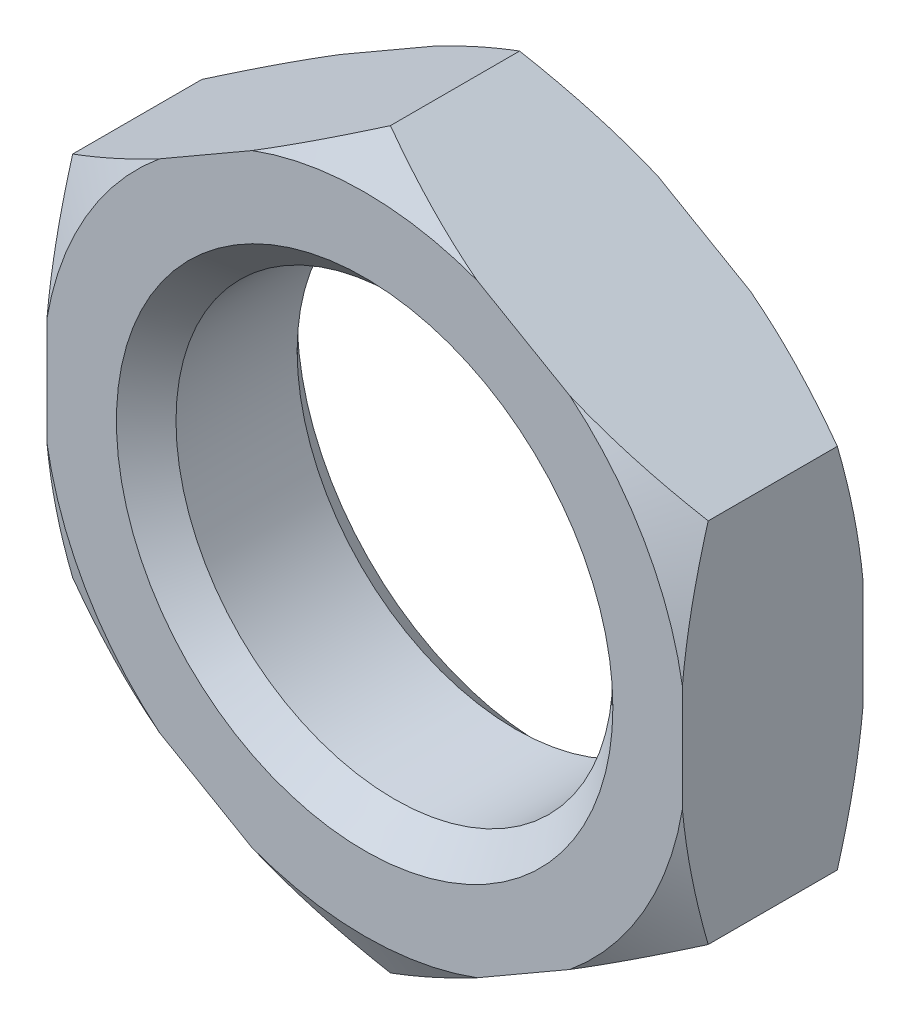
ISO-10303-21;
HEADER;
FILE_DESCRIPTION(('STEP AP214'),'2;1');
FILE_NAME('part.step','',(''),(''),'','','');
FILE_SCHEMA(('AUTOMOTIVE_DESIGN { 1 0 10303 214 1 1 1 1 }'));
ENDSEC;
DATA;
#1=APPLICATION_CONTEXT('core data for automotive mechanical design processes');
#2=APPLICATION_PROTOCOL_DEFINITION('international standard','automotive_design',2000,#1);
#3=PRODUCT_CONTEXT('',#1,'mechanical');
#4=PRODUCT('Part','Part','',(#3));
#5=PRODUCT_RELATED_PRODUCT_CATEGORY('part','',(#4));
#6=PRODUCT_DEFINITION_FORMATION('','',#4);
#7=PRODUCT_DEFINITION_CONTEXT('part definition',#1,'design');
#8=PRODUCT_DEFINITION('design','',#6,#7);
#9=PRODUCT_DEFINITION_SHAPE('','',#8);
#10=(LENGTH_UNIT() NAMED_UNIT(*) SI_UNIT(.MILLI.,.METRE.));
#11=(NAMED_UNIT(*) PLANE_ANGLE_UNIT() SI_UNIT($,.RADIAN.));
#12=(NAMED_UNIT(*) SI_UNIT($,.STERADIAN.) SOLID_ANGLE_UNIT());
#13=UNCERTAINTY_MEASURE_WITH_UNIT(LENGTH_MEASURE(1.E-05),#10,'distance_accuracy_value','');
#14=(GEOMETRIC_REPRESENTATION_CONTEXT(3) GLOBAL_UNCERTAINTY_ASSIGNED_CONTEXT((#13)) GLOBAL_UNIT_ASSIGNED_CONTEXT((#10,
#11,#12)) REPRESENTATION_CONTEXT('',''));
#15=CARTESIAN_POINT('',(0.,0.,0.));
#16=DIRECTION('',(0.,0.,1.));
#17=DIRECTION('',(1.,0.,0.));
#18=AXIS2_PLACEMENT_3D('',#15,#16,#17);
#19=CARTESIAN_POINT('',(16.,9.23760430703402,4.55));
#20=DIRECTION('',(-0.5,-0.866025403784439,0.));
#21=DIRECTION('',(0.866025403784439,-0.5,0.));
#22=AXIS2_PLACEMENT_3D('',#19,#20,#21);
#23=PLANE('',#22);
#24=CARTESIAN_POINT('',(-11.1126929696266,24.8911248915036,1.82043615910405));
#25=CARTESIAN_POINT('',(-10.8613370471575,24.7460044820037,1.68477046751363));
#26=CARTESIAN_POINT('',(-10.6096765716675,24.6007082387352,1.5498576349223));
#27=CARTESIAN_POINT('',(-10.1056931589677,24.3097332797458,1.28168505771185));
#28=CARTESIAN_POINT('',(-9.85337021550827,24.1640545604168,1.14842532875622));
#29=CARTESIAN_POINT('',(-9.09527589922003,23.7263686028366,0.751319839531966));
#30=CARTESIAN_POINT('',(-8.58843760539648,23.433745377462,0.490179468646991));
#31=CARTESIAN_POINT('',(-7.56983458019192,22.8456546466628,-0.0242433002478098));
#32=CARTESIAN_POINT('',(-7.0580592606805,22.5501810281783,-0.277497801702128));
#33=CARTESIAN_POINT('',(-6.03067524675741,21.9570205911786,-0.773398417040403));
#34=CARTESIAN_POINT('',(-5.51506667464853,21.6593338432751,-1.01604486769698));
#35=CARTESIAN_POINT('',(-4.46622839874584,21.0537867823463,-1.49441019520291));
#36=CARTESIAN_POINT('',(-3.93288416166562,20.7458603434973,-1.72979568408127));
#37=CARTESIAN_POINT('',(-2.86081131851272,20.1268987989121,-2.18380640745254));
#38=CARTESIAN_POINT('',(-2.32208245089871,19.8158635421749,-2.40243082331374));
#39=CARTESIAN_POINT('',(-1.23913948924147,19.1906261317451,-2.81875591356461));
#40=CARTESIAN_POINT('',(-0.69493124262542,18.8764273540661,-3.01647674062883));
#41=CARTESIAN_POINT('',(0.39994835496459,18.2442983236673,-3.38644274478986));
#42=CARTESIAN_POINT('',(0.950618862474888,17.9263685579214,-3.55869120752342));
#43=CARTESIAN_POINT('',(1.88596207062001,17.3863479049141,-3.82335527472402));
#44=CARTESIAN_POINT('',(2.26890453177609,17.1652559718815,-3.92392426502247));
#45=CARTESIAN_POINT('',(3.0377694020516,16.7213516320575,-4.10844617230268));
#46=CARTESIAN_POINT('',(3.42369154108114,16.4985393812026,-4.19240057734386));
#47=CARTESIAN_POINT('',(4.19814231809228,16.0514100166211,-4.34180685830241));
#48=CARTESIAN_POINT('',(4.58667034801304,15.8270932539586,-4.40726290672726));
#49=CARTESIAN_POINT('',(5.36589103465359,15.3772099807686,-4.51801432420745));
#50=CARTESIAN_POINT('',(5.75658367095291,15.1516434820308,-4.56330988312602));
#51=CARTESIAN_POINT('',(6.53485590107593,14.7023078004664,-4.63204500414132));
#52=CARTESIAN_POINT('',(6.92241895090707,14.4785481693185,-4.65573229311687));
#53=CARTESIAN_POINT('',(7.69808444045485,14.030717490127,-4.68144071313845));
#54=CARTESIAN_POINT('',(8.08618687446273,13.8066464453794,-4.68346207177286));
#55=CARTESIAN_POINT('',(8.86201600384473,13.3587212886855,-4.66577524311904));
#56=CARTESIAN_POINT('',(9.24974270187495,13.1348671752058,-4.64606721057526));
#57=CARTESIAN_POINT('',(10.0239973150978,12.6878510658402,-4.58551794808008));
#58=CARTESIAN_POINT('',(10.4105250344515,12.4646891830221,-4.54467343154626));
#59=CARTESIAN_POINT('',(11.3234365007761,11.9376195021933,-4.42428095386));
#60=CARTESIAN_POINT('',(11.8489653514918,11.6342052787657,-4.33602284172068));
#61=CARTESIAN_POINT('',(12.8949985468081,11.0302777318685,-4.12620716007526));
#62=CARTESIAN_POINT('',(13.4155021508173,10.7297648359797,-4.00464475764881));
#63=CARTESIAN_POINT('',(14.4514190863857,10.1316779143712,-3.73280906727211));
#64=CARTESIAN_POINT('',(14.9668259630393,9.83410761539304,-3.58250331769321));
#65=CARTESIAN_POINT('',(15.9918560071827,9.24230624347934,-3.25791670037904));
#66=CARTESIAN_POINT('',(16.5014795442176,8.9480749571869,-3.08363737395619));
#67=CARTESIAN_POINT('',(17.521337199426,8.35925986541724,-2.71304854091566));
#68=CARTESIAN_POINT('',(18.0315059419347,8.0647138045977,-2.51650082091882));
#69=CARTESIAN_POINT('',(19.0464383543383,7.4787423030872,-2.10688447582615));
#70=CARTESIAN_POINT('',(19.5512053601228,7.18731493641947,-1.89382680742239));
#71=CARTESIAN_POINT('',(20.5561090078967,6.60713354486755,-1.45413105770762));
#72=CARTESIAN_POINT('',(21.0562468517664,6.31837882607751,-1.22749662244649));
#73=CARTESIAN_POINT('',(22.052657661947,5.74310077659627,-0.762987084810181));
#74=CARTESIAN_POINT('',(22.5489301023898,5.4565777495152,-0.525110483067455));
#75=CARTESIAN_POINT('',(23.3872932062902,4.97254858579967,-0.114011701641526));
#76=CARTESIAN_POINT('',(23.7302685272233,4.77453169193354,0.0568151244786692));
#77=CARTESIAN_POINT('',(24.4147129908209,4.37936749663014,0.402409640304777));
#78=CARTESIAN_POINT('',(24.756182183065,4.18222016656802,0.577177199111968));
#79=CARTESIAN_POINT('',(25.4341670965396,3.79078539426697,0.928322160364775));
#80=CARTESIAN_POINT('',(25.7706970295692,3.59648974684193,1.1046630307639));
#81=CARTESIAN_POINT('',(26.4425619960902,3.20858832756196,1.46037318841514));
#82=CARTESIAN_POINT('',(26.7778970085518,3.01498256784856,1.63974252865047));
#83=CARTESIAN_POINT('',(27.1126929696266,2.82168802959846,1.82043615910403));
#84=B_SPLINE_CURVE_WITH_KNOTS('',3,(#24,#25,#26,#27,#28,#29,#30,#31,#32,#33,#34,#35,#36,#37,#38,
#39,#40,#41,#42,#43,#44,#45,#46,#47,#48,#49,#50,#51,#52,#53,#54,#55,#56,#57,#58,#59,#60,#61,#62,
#63,#64,#65,#66,#67,#68,#69,#70,#71,#72,#73,#74,#75,#76,#77,#78,#79,#80,#81,#82,#83),
.UNSPECIFIED.,.F.,.F.,(4,2,2,2,2,2,2,2,2,2,2,2,2,2,2,2,2,2,2,2,2,2,2,2,2,2,2,2,2,4),(0.,
0.961145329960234,1.92229976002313,3.84483265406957,5.77353317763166,7.70217242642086,
9.67988739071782,11.6576988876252,13.6335858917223,15.6092178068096,16.9693761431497,
18.329412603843,19.6891420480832,21.0488586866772,22.3927835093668,23.7366942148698,
25.0805953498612,26.4247055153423,28.2632323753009,30.1020261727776,31.942909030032,
33.7836735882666,35.6464188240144,37.5079382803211,39.3689600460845,41.2302307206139,
42.5241267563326,43.8179798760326,45.0981593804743,46.3783613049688),.UNSPECIFIED.);
#85=CARTESIAN_POINT('',(0.,18.475208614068,-3.25096189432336));
#86=VERTEX_POINT('',#85);
#87=CARTESIAN_POINT('',(5.66696636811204,15.20338405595,-4.55));
#88=VERTEX_POINT('',#87);
#89=EDGE_CURVE('E177',#86,#88,#84,.T.);
#90=ORIENTED_EDGE('',*,*,#89,.F.);
#91=DIRECTION('',(0.,0.,-1.));
#92=VECTOR('',#91,1.);
#93=CARTESIAN_POINT('',(0.,18.475208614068,4.55));
#94=LINE('',#93,#92);
#95=CARTESIAN_POINT('',(0.,18.475208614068,3.25096189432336));
#96=VERTEX_POINT('',#95);
#97=EDGE_CURVE('E222',#96,#86,#94,.T.);
#98=ORIENTED_EDGE('',*,*,#97,.F.);
#99=CARTESIAN_POINT('',(27.1126929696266,2.82168802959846,-1.82043615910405));
#100=CARTESIAN_POINT('',(26.8613370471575,2.9668084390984,-1.68477046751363));
#101=CARTESIAN_POINT('',(26.6096765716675,3.1121046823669,-1.54985763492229));
#102=CARTESIAN_POINT('',(26.1056931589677,3.40307964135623,-1.28168505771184));
#103=CARTESIAN_POINT('',(25.8533702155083,3.54875836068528,-1.14842532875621));
#104=CARTESIAN_POINT('',(25.09527589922,3.98644431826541,-0.751319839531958));
#105=CARTESIAN_POINT('',(24.5884376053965,4.27906754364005,-0.490179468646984));
#106=CARTESIAN_POINT('',(23.5698345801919,4.86715827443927,0.0242433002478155));
#107=CARTESIAN_POINT('',(23.0580592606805,5.1626318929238,0.277497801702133));
#108=CARTESIAN_POINT('',(22.0306752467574,5.75579232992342,0.773398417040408));
#109=CARTESIAN_POINT('',(21.5150666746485,6.05347907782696,1.01604486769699));
#110=CARTESIAN_POINT('',(20.4662283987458,6.65902613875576,1.49441019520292));
#111=CARTESIAN_POINT('',(19.9328841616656,6.96695257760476,1.72979568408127));
#112=CARTESIAN_POINT('',(18.8608113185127,7.58591412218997,2.18380640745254));
#113=CARTESIAN_POINT('',(18.3220824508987,7.89694937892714,2.40243082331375));
#114=CARTESIAN_POINT('',(17.2391394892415,8.52218678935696,2.81875591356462));
#115=CARTESIAN_POINT('',(16.6949312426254,8.83638556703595,3.01647674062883));
#116=CARTESIAN_POINT('',(15.6000516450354,9.46851459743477,3.38644274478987));
#117=CARTESIAN_POINT('',(15.0493811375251,9.78644436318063,3.55869120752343));
#118=CARTESIAN_POINT('',(14.11403792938,10.3264650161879,3.82335527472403));
#119=CARTESIAN_POINT('',(13.7310954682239,10.5475569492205,3.92392426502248));
#120=CARTESIAN_POINT('',(12.9622305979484,10.9914612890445,4.10844617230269));
#121=CARTESIAN_POINT('',(12.5763084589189,11.2142735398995,4.19240057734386));
#122=CARTESIAN_POINT('',(11.8018576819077,11.661402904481,4.34180685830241));
#123=CARTESIAN_POINT('',(11.413329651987,11.8857196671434,4.40726290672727));
#124=CARTESIAN_POINT('',(10.6341089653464,12.3356029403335,4.51801432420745));
#125=CARTESIAN_POINT('',(10.2434163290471,12.5611694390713,4.56330988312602));
#126=CARTESIAN_POINT('',(9.46514409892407,13.0105051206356,4.63204500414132));
#127=CARTESIAN_POINT('',(9.07758104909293,13.2342647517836,4.65573229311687));
#128=CARTESIAN_POINT('',(8.30191555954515,13.6820954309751,4.68144071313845));
#129=CARTESIAN_POINT('',(7.91381312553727,13.9061664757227,4.68346207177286));
#130=CARTESIAN_POINT('',(7.13798399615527,14.3540916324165,4.66577524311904));
#131=CARTESIAN_POINT('',(6.75025729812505,14.5779457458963,4.64606721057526));
#132=CARTESIAN_POINT('',(5.97600268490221,15.0249618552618,4.58551794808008));
#133=CARTESIAN_POINT('',(5.58947496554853,15.2481237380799,4.54467343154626));
#134=CARTESIAN_POINT('',(4.6765634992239,15.7751934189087,4.42428095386));
#135=CARTESIAN_POINT('',(4.15103464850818,16.0786076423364,4.33602284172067));
#136=CARTESIAN_POINT('',(3.1050014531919,16.6825351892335,4.12620716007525));
#137=CARTESIAN_POINT('',(2.58449784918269,16.9830480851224,4.0046447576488));
#138=CARTESIAN_POINT('',(1.54858091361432,17.5811350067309,3.7328090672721));
#139=CARTESIAN_POINT('',(1.03317403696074,17.878705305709,3.5825033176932));
#140=CARTESIAN_POINT('',(0.00814399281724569,18.4705066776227,3.25791670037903));
#141=CARTESIAN_POINT('',(-0.501479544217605,18.7647379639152,3.08363737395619));
#142=CARTESIAN_POINT('',(-1.52133719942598,19.3535530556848,2.71304854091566));
#143=CARTESIAN_POINT('',(-2.03150594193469,19.6480991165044,2.51650082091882));
#144=CARTESIAN_POINT('',(-3.04643835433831,20.2340706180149,2.10688447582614));
#145=CARTESIAN_POINT('',(-3.55120536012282,20.5254979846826,1.89382680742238));
#146=CARTESIAN_POINT('',(-4.55610900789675,21.1056793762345,1.45413105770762));
#147=CARTESIAN_POINT('',(-5.05624685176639,21.3944340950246,1.22749662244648));
#148=CARTESIAN_POINT('',(-6.05265766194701,21.9697121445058,0.762987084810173));
#149=CARTESIAN_POINT('',(-6.54893010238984,22.2562351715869,0.525110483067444));
#150=CARTESIAN_POINT('',(-7.38729320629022,22.7402643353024,0.114011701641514));
#151=CARTESIAN_POINT('',(-7.73026852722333,22.9382812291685,-0.0568151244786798));
#152=CARTESIAN_POINT('',(-8.41471299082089,23.3334454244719,-0.402409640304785));
#153=CARTESIAN_POINT('',(-8.75618218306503,23.530592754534,-0.577177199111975));
#154=CARTESIAN_POINT('',(-9.43416709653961,23.9220275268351,-0.928322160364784));
#155=CARTESIAN_POINT('',(-9.77069702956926,24.1163231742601,-1.10466303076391));
#156=CARTESIAN_POINT('',(-10.4425619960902,24.5042245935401,-1.46037318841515));
#157=CARTESIAN_POINT('',(-10.7778970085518,24.6978303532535,-1.63974252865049));
#158=CARTESIAN_POINT('',(-11.1126929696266,24.8911248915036,-1.82043615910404));
#159=B_SPLINE_CURVE_WITH_KNOTS('',3,(#99,#100,#101,#102,#103,#104,#105,#106,#107,#108,#109,#110,
#111,#112,#113,#114,#115,#116,#117,#118,#119,#120,#121,#122,#123,#124,#125,#126,#127,#128,#129,
#130,#131,#132,#133,#134,#135,#136,#137,#138,#139,#140,#141,#142,#143,#144,#145,#146,#147,#148,
#149,#150,#151,#152,#153,#154,#155,#156,#157,#158),.UNSPECIFIED.,.F.,.F.,(4,2,2,2,2,2,2,2,2,2,2,
2,2,2,2,2,2,2,2,2,2,2,2,2,2,2,2,2,2,4),(0.,0.961145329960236,1.92229976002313,3.84483265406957,
5.77353317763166,7.70217242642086,9.67988739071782,11.6576988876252,13.6335858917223,
15.6092178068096,16.9693761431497,18.329412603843,19.6891420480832,21.0488586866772,
22.3927835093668,23.7366942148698,25.0805953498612,26.4247055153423,28.2632323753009,
30.1020261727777,31.942909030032,33.7836735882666,35.6464188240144,37.5079382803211,
39.3689600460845,41.2302307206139,42.5241267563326,43.8179798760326,45.0981593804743,
46.3783613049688),.UNSPECIFIED.);
#160=CARTESIAN_POINT('',(5.66696636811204,15.20338405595,4.55));
#161=VERTEX_POINT('',#160);
#162=EDGE_CURVE('E374',#161,#96,#159,.T.);
#163=ORIENTED_EDGE('',*,*,#162,.F.);
#164=DIRECTION('',(-0.866025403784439,0.5,0.));
#165=VECTOR('',#164,1.);
#166=CARTESIAN_POINT('',(16.,9.23760430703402,4.55));
#167=LINE('',#166,#165);
#168=CARTESIAN_POINT('',(10.333033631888,12.5094288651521,4.55));
#169=VERTEX_POINT('',#168);
#170=EDGE_CURVE('E352',#169,#161,#167,.T.);
#171=ORIENTED_EDGE('',*,*,#170,.F.);
#172=CARTESIAN_POINT('',(16.,9.23760430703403,3.25096189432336));
#173=VERTEX_POINT('',#172);
#174=EDGE_CURVE('E194',#173,#169,#159,.T.);
#175=ORIENTED_EDGE('',*,*,#174,.F.);
#176=DIRECTION('',(0.,0.,-1.));
#177=VECTOR('',#176,1.);
#178=CARTESIAN_POINT('',(16.,9.23760430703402,4.55));
#179=LINE('',#178,#177);
#180=CARTESIAN_POINT('',(16.,9.23760430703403,-3.25096189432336));
#181=VERTEX_POINT('',#180);
#182=EDGE_CURVE('E183',#173,#181,#179,.T.);
#183=ORIENTED_EDGE('',*,*,#182,.T.);
#184=CARTESIAN_POINT('',(10.333033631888,12.5094288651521,-4.55));
#185=VERTEX_POINT('',#184);
#186=EDGE_CURVE('E164',#185,#181,#84,.T.);
#187=ORIENTED_EDGE('',*,*,#186,.F.);
#188=DIRECTION('',(-0.866025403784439,0.5,0.));
#189=VECTOR('',#188,1.);
#190=CARTESIAN_POINT('',(16.,9.23760430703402,-4.55));
#191=LINE('',#190,#189);
#192=EDGE_CURVE('E265',#185,#88,#191,.T.);
#193=ORIENTED_EDGE('',*,*,#192,.T.);
#194=EDGE_LOOP('',(#90,#98,#163,#171,#175,#183,#187,#193));
#195=FACE_BOUND('',#194,.T.);
#196=ADVANCED_FACE('F39',(#195),#23,.F.);
#197=CARTESIAN_POINT('',(0.,18.475208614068,4.55));
#198=DIRECTION('',(0.5,-0.866025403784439,0.));
#199=DIRECTION('',(0.866025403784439,0.5,0.));
#200=AXIS2_PLACEMENT_3D('',#197,#198,#199);
#201=PLANE('',#200);
#202=CARTESIAN_POINT('',(-27.1126929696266,2.82168802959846,1.82043615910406));
#203=CARTESIAN_POINT('',(-26.8613370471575,2.9668084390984,1.68477046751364));
#204=CARTESIAN_POINT('',(-26.6096765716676,3.11210468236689,1.5498576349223));
#205=CARTESIAN_POINT('',(-26.1056931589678,3.40307964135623,1.28168505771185));
#206=CARTESIAN_POINT('',(-25.8533702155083,3.54875836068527,1.14842532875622));
#207=CARTESIAN_POINT('',(-25.09527589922,3.98644431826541,0.751319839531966));
#208=CARTESIAN_POINT('',(-24.5884376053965,4.27906754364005,0.490179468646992));
#209=CARTESIAN_POINT('',(-23.5698345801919,4.86715827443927,-0.0242433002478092));
#210=CARTESIAN_POINT('',(-23.0580592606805,5.1626318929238,-0.277497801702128));
#211=CARTESIAN_POINT('',(-22.0306752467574,5.75579232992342,-0.773398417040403));
#212=CARTESIAN_POINT('',(-21.5150666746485,6.05347907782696,-1.01604486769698));
#213=CARTESIAN_POINT('',(-20.4662283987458,6.65902613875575,-1.49441019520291));
#214=CARTESIAN_POINT('',(-19.9328841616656,6.96695257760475,-1.72979568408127));
#215=CARTESIAN_POINT('',(-18.8608113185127,7.58591412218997,-2.18380640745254));
#216=CARTESIAN_POINT('',(-18.3220824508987,7.89694937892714,-2.40243082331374));
#217=CARTESIAN_POINT('',(-17.2391394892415,8.52218678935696,-2.81875591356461));
#218=CARTESIAN_POINT('',(-16.6949312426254,8.83638556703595,-3.01647674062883));
#219=CARTESIAN_POINT('',(-15.6000516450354,9.46851459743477,-3.38644274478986));
#220=CARTESIAN_POINT('',(-15.0493811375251,9.78644436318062,-3.55869120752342));
#221=CARTESIAN_POINT('',(-14.11403792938,10.3264650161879,-3.82335527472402));
#222=CARTESIAN_POINT('',(-13.7310954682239,10.5475569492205,-3.92392426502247));
#223=CARTESIAN_POINT('',(-12.9622305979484,10.9914612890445,-4.10844617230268));
#224=CARTESIAN_POINT('',(-12.5763084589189,11.2142735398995,-4.19240057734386));
#225=CARTESIAN_POINT('',(-11.8018576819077,11.6614029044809,-4.34180685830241));
#226=CARTESIAN_POINT('',(-11.413329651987,11.8857196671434,-4.40726290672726));
#227=CARTESIAN_POINT('',(-10.6341089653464,12.3356029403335,-4.51801432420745));
#228=CARTESIAN_POINT('',(-10.2434163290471,12.5611694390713,-4.56330988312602));
#229=CARTESIAN_POINT('',(-9.46514409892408,13.0105051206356,-4.63204500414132));
#230=CARTESIAN_POINT('',(-9.07758104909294,13.2342647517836,-4.65573229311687));
#231=CARTESIAN_POINT('',(-8.30191555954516,13.6820954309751,-4.68144071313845));
#232=CARTESIAN_POINT('',(-7.91381312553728,13.9061664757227,-4.68346207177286));
#233=CARTESIAN_POINT('',(-7.13798399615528,14.3540916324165,-4.66577524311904));
#234=CARTESIAN_POINT('',(-6.75025729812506,14.5779457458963,-4.64606721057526));
#235=CARTESIAN_POINT('',(-5.97600268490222,15.0249618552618,-4.58551794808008));
#236=CARTESIAN_POINT('',(-5.58947496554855,15.2481237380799,-4.54467343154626));
#237=CARTESIAN_POINT('',(-4.67656349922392,15.7751934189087,-4.42428095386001));
#238=CARTESIAN_POINT('',(-4.1510346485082,16.0786076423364,-4.33602284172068));
#239=CARTESIAN_POINT('',(-3.10500145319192,16.6825351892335,-4.12620716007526));
#240=CARTESIAN_POINT('',(-2.5844978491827,16.9830480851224,-4.00464475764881));
#241=CARTESIAN_POINT('',(-1.54858091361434,17.5811350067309,-3.73280906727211));
#242=CARTESIAN_POINT('',(-1.03317403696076,17.878705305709,-3.58250331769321));
#243=CARTESIAN_POINT('',(-0.00814399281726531,18.4705066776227,-3.25791670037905));
#244=CARTESIAN_POINT('',(0.501479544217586,18.7647379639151,-3.0836373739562));
#245=CARTESIAN_POINT('',(1.52133719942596,19.3535530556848,-2.71304854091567));
#246=CARTESIAN_POINT('',(2.03150594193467,19.6480991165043,-2.51650082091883));
#247=CARTESIAN_POINT('',(3.04643835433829,20.2340706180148,-2.10688447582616));
#248=CARTESIAN_POINT('',(3.5512053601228,20.5254979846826,-1.8938268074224));
#249=CARTESIAN_POINT('',(4.55610900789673,21.1056793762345,-1.45413105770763));
#250=CARTESIAN_POINT('',(5.05624685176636,21.3944340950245,-1.22749662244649));
#251=CARTESIAN_POINT('',(6.05265766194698,21.9697121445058,-0.76298708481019));
#252=CARTESIAN_POINT('',(6.54893010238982,22.2562351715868,-0.525110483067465));
#253=CARTESIAN_POINT('',(7.38729320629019,22.7402643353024,-0.114011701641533));
#254=CARTESIAN_POINT('',(7.73026852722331,22.9382812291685,0.0568151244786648));
#255=CARTESIAN_POINT('',(8.41471299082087,23.3334454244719,0.402409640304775));
#256=CARTESIAN_POINT('',(8.75618218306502,23.530592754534,0.577177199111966));
#257=CARTESIAN_POINT('',(9.4341670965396,23.9220275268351,0.928322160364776));
#258=CARTESIAN_POINT('',(9.77069702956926,24.1163231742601,1.1046630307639));
#259=CARTESIAN_POINT('',(10.4425619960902,24.5042245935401,1.46037318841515));
#260=CARTESIAN_POINT('',(10.7778970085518,24.6978303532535,1.63974252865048));
#261=CARTESIAN_POINT('',(11.1126929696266,24.8911248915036,1.82043615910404));
#262=B_SPLINE_CURVE_WITH_KNOTS('',3,(#202,#203,#204,#205,#206,#207,#208,#209,#210,#211,#212,
#213,#214,#215,#216,#217,#218,#219,#220,#221,#222,#223,#224,#225,#226,#227,#228,#229,#230,#231,
#232,#233,#234,#235,#236,#237,#238,#239,#240,#241,#242,#243,#244,#245,#246,#247,#248,#249,#250,
#251,#252,#253,#254,#255,#256,#257,#258,#259,#260,#261),.UNSPECIFIED.,.F.,.F.,(4,2,2,2,2,2,2,2,
2,2,2,2,2,2,2,2,2,2,2,2,2,2,2,2,2,2,2,2,2,4),(0.,0.961145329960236,1.92229976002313,
3.84483265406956,5.77353317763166,7.70217242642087,9.67988739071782,11.6576988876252,
13.6335858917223,15.6092178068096,16.9693761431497,18.329412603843,19.6891420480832,
21.0488586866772,22.3927835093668,23.7366942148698,25.0805953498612,26.4247055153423,
28.2632323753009,30.1020261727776,31.942909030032,33.7836735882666,35.6464188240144,
37.5079382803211,39.3689600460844,41.2302307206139,42.5241267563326,43.8179798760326,
45.0981593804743,46.3783613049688),.UNSPECIFIED.);
#263=CARTESIAN_POINT('',(-16.,9.23760430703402,-3.25096189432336));
#264=VERTEX_POINT('',#263);
#265=CARTESIAN_POINT('',(-10.333033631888,12.509428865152,-4.55));
#266=VERTEX_POINT('',#265);
#267=EDGE_CURVE('E55',#264,#266,#262,.T.);
#268=ORIENTED_EDGE('',*,*,#267,.F.);
#269=DIRECTION('',(0.,0.,-1.));
#270=VECTOR('',#269,1.);
#271=CARTESIAN_POINT('',(-16.,9.23760430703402,4.55));
#272=LINE('',#271,#270);
#273=CARTESIAN_POINT('',(-16.,9.23760430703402,3.25096189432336));
#274=VERTEX_POINT('',#273);
#275=EDGE_CURVE('E218',#274,#264,#272,.T.);
#276=ORIENTED_EDGE('',*,*,#275,.F.);
#277=CARTESIAN_POINT('',(11.1126929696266,24.8911248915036,-1.82043615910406));
#278=CARTESIAN_POINT('',(10.8613370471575,24.7460044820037,-1.68477046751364));
#279=CARTESIAN_POINT('',(10.6096765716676,24.6007082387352,-1.5498576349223));
#280=CARTESIAN_POINT('',(10.1056931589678,24.3097332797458,-1.28168505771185));
#281=CARTESIAN_POINT('',(9.85337021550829,24.1640545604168,-1.14842532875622));
#282=CARTESIAN_POINT('',(9.09527589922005,23.7263686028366,-0.751319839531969));
#283=CARTESIAN_POINT('',(8.5884376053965,23.433745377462,-0.490179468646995));
#284=CARTESIAN_POINT('',(7.56983458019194,22.8456546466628,0.0242433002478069));
#285=CARTESIAN_POINT('',(7.05805926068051,22.5501810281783,0.277497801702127));
#286=CARTESIAN_POINT('',(6.03067524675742,21.9570205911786,0.773398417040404));
#287=CARTESIAN_POINT('',(5.51506667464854,21.6593338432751,1.01604486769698));
#288=CARTESIAN_POINT('',(4.46622839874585,21.0537867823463,1.49441019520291));
#289=CARTESIAN_POINT('',(3.93288416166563,20.7458603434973,1.72979568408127));
#290=CARTESIAN_POINT('',(2.86081131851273,20.1268987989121,2.18380640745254));
#291=CARTESIAN_POINT('',(2.32208245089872,19.8158635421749,2.40243082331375));
#292=CARTESIAN_POINT('',(1.23913948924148,19.1906261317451,2.81875591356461));
#293=CARTESIAN_POINT('',(0.694931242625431,18.8764273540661,3.01647674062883));
#294=CARTESIAN_POINT('',(-0.399948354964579,18.2442983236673,3.38644274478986));
#295=CARTESIAN_POINT('',(-0.950618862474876,17.9263685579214,3.55869120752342));
#296=CARTESIAN_POINT('',(-1.88596207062,17.3863479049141,3.82335527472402));
#297=CARTESIAN_POINT('',(-2.26890453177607,17.1652559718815,3.92392426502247));
#298=CARTESIAN_POINT('',(-3.03776940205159,16.7213516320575,4.10844617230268));
#299=CARTESIAN_POINT('',(-3.42369154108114,16.4985393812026,4.19240057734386));
#300=CARTESIAN_POINT('',(-4.19814231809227,16.0514100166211,4.34180685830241));
#301=CARTESIAN_POINT('',(-4.58667034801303,15.8270932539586,4.40726290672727));
#302=CARTESIAN_POINT('',(-5.36589103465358,15.3772099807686,4.51801432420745));
#303=CARTESIAN_POINT('',(-5.7565836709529,15.1516434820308,4.56330988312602));
#304=CARTESIAN_POINT('',(-6.53485590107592,14.7023078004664,4.63204500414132));
#305=CARTESIAN_POINT('',(-6.92241895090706,14.4785481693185,4.65573229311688));
#306=CARTESIAN_POINT('',(-7.69808444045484,14.030717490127,4.68144071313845));
#307=CARTESIAN_POINT('',(-8.08618687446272,13.8066464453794,4.68346207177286));
#308=CARTESIAN_POINT('',(-8.86201600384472,13.3587212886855,4.66577524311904));
#309=CARTESIAN_POINT('',(-9.24974270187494,13.1348671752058,4.64606721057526));
#310=CARTESIAN_POINT('',(-10.0239973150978,12.6878510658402,4.58551794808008));
#311=CARTESIAN_POINT('',(-10.4105250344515,12.4646891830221,4.54467343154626));
#312=CARTESIAN_POINT('',(-11.3234365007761,11.9376195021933,4.42428095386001));
#313=CARTESIAN_POINT('',(-11.8489653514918,11.6342052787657,4.33602284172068));
#314=CARTESIAN_POINT('',(-12.8949985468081,11.0302777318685,4.12620716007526));
#315=CARTESIAN_POINT('',(-13.4155021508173,10.7297648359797,4.00464475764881));
#316=CARTESIAN_POINT('',(-14.4514190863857,10.1316779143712,3.73280906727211));
#317=CARTESIAN_POINT('',(-14.9668259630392,9.83410761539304,3.58250331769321));
#318=CARTESIAN_POINT('',(-15.9918560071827,9.24230624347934,3.25791670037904));
#319=CARTESIAN_POINT('',(-16.5014795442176,8.9480749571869,3.08363737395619));
#320=CARTESIAN_POINT('',(-17.521337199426,8.35925986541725,2.71304854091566));
#321=CARTESIAN_POINT('',(-18.0315059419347,8.06471380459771,2.51650082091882));
#322=CARTESIAN_POINT('',(-19.0464383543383,7.4787423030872,2.10688447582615));
#323=CARTESIAN_POINT('',(-19.5512053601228,7.18731493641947,1.89382680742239));
#324=CARTESIAN_POINT('',(-20.5561090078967,6.60713354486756,1.45413105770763));
#325=CARTESIAN_POINT('',(-21.0562468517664,6.31837882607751,1.22749662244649));
#326=CARTESIAN_POINT('',(-22.052657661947,5.74310077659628,0.762987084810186));
#327=CARTESIAN_POINT('',(-22.5489301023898,5.45657774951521,0.525110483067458));
#328=CARTESIAN_POINT('',(-23.3872932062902,4.97254858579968,0.114011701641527));
#329=CARTESIAN_POINT('',(-23.7302685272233,4.77453169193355,-0.0568151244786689));
#330=CARTESIAN_POINT('',(-24.4147129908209,4.37936749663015,-0.402409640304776));
#331=CARTESIAN_POINT('',(-24.756182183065,4.18222016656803,-0.577177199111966));
#332=CARTESIAN_POINT('',(-25.4341670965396,3.79078539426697,-0.928322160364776));
#333=CARTESIAN_POINT('',(-25.7706970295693,3.59648974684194,-1.1046630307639));
#334=CARTESIAN_POINT('',(-26.4425619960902,3.20858832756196,-1.46037318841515));
#335=CARTESIAN_POINT('',(-26.7778970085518,3.01498256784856,-1.63974252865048));
#336=CARTESIAN_POINT('',(-27.1126929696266,2.82168802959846,-1.82043615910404));
#337=B_SPLINE_CURVE_WITH_KNOTS('',3,(#277,#278,#279,#280,#281,#282,#283,#284,#285,#286,#287,
#288,#289,#290,#291,#292,#293,#294,#295,#296,#297,#298,#299,#300,#301,#302,#303,#304,#305,#306,
#307,#308,#309,#310,#311,#312,#313,#314,#315,#316,#317,#318,#319,#320,#321,#322,#323,#324,#325,
#326,#327,#328,#329,#330,#331,#332,#333,#334,#335,#336),.UNSPECIFIED.,.F.,.F.,(4,2,2,2,2,2,2,2,
2,2,2,2,2,2,2,2,2,2,2,2,2,2,2,2,2,2,2,2,2,4),(0.,0.961145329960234,1.92229976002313,
3.84483265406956,5.77353317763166,7.70217242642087,9.67988739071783,11.6576988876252,
13.6335858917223,15.6092178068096,16.9693761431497,18.329412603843,19.6891420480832,
21.0488586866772,22.3927835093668,23.7366942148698,25.0805953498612,26.4247055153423,
28.2632323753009,30.1020261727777,31.942909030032,33.7836735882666,35.6464188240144,
37.5079382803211,39.3689600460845,41.2302307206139,42.5241267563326,43.8179798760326,
45.0981593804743,46.3783613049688),.UNSPECIFIED.);
#338=CARTESIAN_POINT('',(-10.333033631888,12.509428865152,4.55));
#339=VERTEX_POINT('',#338);
#340=EDGE_CURVE('E345',#339,#274,#337,.T.);
#341=ORIENTED_EDGE('',*,*,#340,.F.);
#342=DIRECTION('',(-0.866025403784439,-0.5,0.));
#343=VECTOR('',#342,1.);
#344=CARTESIAN_POINT('',(0.,18.475208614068,4.55));
#345=LINE('',#344,#343);
#346=CARTESIAN_POINT('',(-5.66696636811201,15.20338405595,4.55));
#347=VERTEX_POINT('',#346);
#348=EDGE_CURVE('E356',#347,#339,#345,.T.);
#349=ORIENTED_EDGE('',*,*,#348,.F.);
#350=EDGE_CURVE('E351',#96,#347,#337,.T.);
#351=ORIENTED_EDGE('',*,*,#350,.F.);
#352=ORIENTED_EDGE('',*,*,#97,.T.);
#353=CARTESIAN_POINT('',(-5.66696636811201,15.20338405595,-4.55));
#354=VERTEX_POINT('',#353);
#355=EDGE_CURVE('E433',#354,#86,#262,.T.);
#356=ORIENTED_EDGE('',*,*,#355,.F.);
#357=DIRECTION('',(-0.866025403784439,-0.5,0.));
#358=VECTOR('',#357,1.);
#359=CARTESIAN_POINT('',(0.,18.475208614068,-4.55));
#360=LINE('',#359,#358);
#361=EDGE_CURVE('E373',#354,#266,#360,.T.);
#362=ORIENTED_EDGE('',*,*,#361,.T.);
#363=EDGE_LOOP('',(#268,#276,#341,#349,#351,#352,#356,#362));
#364=FACE_BOUND('',#363,.T.);
#365=ADVANCED_FACE('F325',(#364),#201,.F.);
#366=CARTESIAN_POINT('',(-16.,9.23760430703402,4.55));
#367=DIRECTION('',(1.,0.,0.));
#368=DIRECTION('',(0.,0.,-1.));
#369=AXIS2_PLACEMENT_3D('',#366,#367,#368);
#370=PLANE('',#369);
#371=CARTESIAN_POINT('',(-16.,-20.3502972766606,1.02821366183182));
#372=CARTESIAN_POINT('',(-16.,-20.0612762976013,0.8970391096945));
#373=CARTESIAN_POINT('',(-16.,-19.7718560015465,0.766745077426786));
#374=CARTESIAN_POINT('',(-16.,-19.1921458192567,0.508095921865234));
#375=CARTESIAN_POINT('',(-16.,-18.9018559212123,0.379740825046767));
#376=CARTESIAN_POINT('',(-16.,-18.0294896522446,-0.00218663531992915));
#377=CARTESIAN_POINT('',(-16.,-17.446013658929,-0.25257702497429));
#378=CARTESIAN_POINT('',(-16.,-16.2723074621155,-0.744118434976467));
#379=CARTESIAN_POINT('',(-16.,-15.6820592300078,-0.985226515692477));
#380=CARTESIAN_POINT('',(-16.,-14.4965742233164,-1.45482162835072));
#381=CARTESIAN_POINT('',(-16.,-13.9013376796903,-1.68330924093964));
#382=CARTESIAN_POINT('',(-16.,-12.7078110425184,-2.12386159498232));
#383=CARTESIAN_POINT('',(-16.,-12.1095464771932,-2.33599515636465));
#384=CARTESIAN_POINT('',(-16.,-10.9066231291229,-2.74152289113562));
#385=CARTESIAN_POINT('',(-16.,-10.3019640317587,-2.93491613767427));
#386=CARTESIAN_POINT('',(-16.,-9.08653747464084,-3.29853558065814));
#387=CARTESIAN_POINT('',(-16.,-8.47577912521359,-3.4687920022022));
#388=CARTESIAN_POINT('',(-16.,-7.24719467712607,-3.78158470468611));
#389=CARTESIAN_POINT('',(-16.,-6.62936957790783,-3.92412485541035));
#390=CARTESIAN_POINT('',(-16.,-5.56284091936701,-4.14059110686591));
#391=CARTESIAN_POINT('',(-16.,-5.11576067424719,-4.22251883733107));
#392=CARTESIAN_POINT('',(-16.,-4.21854415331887,-4.36757225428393));
#393=CARTESIAN_POINT('',(-16.,-3.76840797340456,-4.4306985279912));
#394=CARTESIAN_POINT('',(-16.,-2.865832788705,-4.53648016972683));
#395=CARTESIAN_POINT('',(-16.,-2.41339439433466,-4.57914070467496));
#396=CARTESIAN_POINT('',(-16.,-1.50698138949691,-4.64277580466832));
#397=CARTESIAN_POINT('',(-16.,-1.05300678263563,-4.66375042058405));
#398=CARTESIAN_POINT('',(-16.,-0.144804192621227,-4.68335958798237));
#399=CARTESIAN_POINT('',(-16.,0.309423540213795,-4.68200562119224));
#400=CARTESIAN_POINT('',(-16.,1.21725756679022,-4.6570288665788));
#401=CARTESIAN_POINT('',(-16.,1.67086386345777,-4.63340618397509));
#402=CARTESIAN_POINT('',(-16.,2.57647375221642,-4.56461333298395));
#403=CARTESIAN_POINT('',(-16.,3.02847717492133,-4.51944095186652));
#404=CARTESIAN_POINT('',(-16.,3.92998755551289,-4.40884892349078));
#405=CARTESIAN_POINT('',(-16.,4.37949440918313,-4.34342843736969));
#406=CARTESIAN_POINT('',(-16.,5.49942640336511,-4.15665171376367));
#407=CARTESIAN_POINT('',(-16.,6.16792388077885,-4.0236831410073));
#408=CARTESIAN_POINT('',(-16.,7.49689987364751,-3.72237781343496));
#409=CARTESIAN_POINT('',(-16.,8.15737657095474,-3.55403319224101));
#410=CARTESIAN_POINT('',(-16.,9.47162126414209,-3.18792671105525));
#411=CARTESIAN_POINT('',(-16.,10.1253711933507,-2.99010061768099));
#412=CARTESIAN_POINT('',(-16.,11.425163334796,-2.57091474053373));
#413=CARTESIAN_POINT('',(-16.,12.0712060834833,-2.34955660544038));
#414=CARTESIAN_POINT('',(-16.,13.3638199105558,-1.88527315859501));
#415=CARTESIAN_POINT('',(-16.,14.0103121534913,-1.64212970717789));
#416=CARTESIAN_POINT('',(-16.,15.2972493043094,-1.14029551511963));
#417=CARTESIAN_POINT('',(-16.,15.9376938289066,-0.881603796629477));
#418=CARTESIAN_POINT('',(-16.,17.2093975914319,-0.353342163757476));
#419=CARTESIAN_POINT('',(-16.,17.8406891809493,-0.0838498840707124));
#420=CARTESIAN_POINT('',(-16.,18.7842432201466,0.327903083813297));
#421=CARTESIAN_POINT('',(-16.,19.0981612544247,0.466390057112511));
#422=CARTESIAN_POINT('',(-16.,19.7249740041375,0.745646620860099));
#423=CARTESIAN_POINT('',(-16.,20.0378687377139,0.886416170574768));
#424=CARTESIAN_POINT('',(-16.,20.3502972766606,1.02821366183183));
#425=B_SPLINE_CURVE_WITH_KNOTS('',3,(#371,#372,#373,#374,#375,#376,#377,#378,#379,#380,#381,
#382,#383,#384,#385,#386,#387,#388,#389,#390,#391,#392,#393,#394,#395,#396,#397,#398,#399,#400,
#401,#402,#403,#404,#405,#406,#407,#408,#409,#410,#411,#412,#413,#414,#415,#416,#417,#418,#419,
#420,#421,#422,#423,#424),.UNSPECIFIED.,.F.,.F.,(4,2,2,2,2,2,2,2,2,2,2,2,2,2,2,2,2,2,2,2,2,2,2,
2,2,2,4),(0.,0.952183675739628,1.90438034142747,3.8090932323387,5.72175843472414,
7.6343355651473,9.53836678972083,11.4424921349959,13.3441055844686,15.2454533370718,
16.6086805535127,17.9718651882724,19.3347054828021,20.6975425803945,22.059678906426,
23.4218087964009,24.784078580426,26.1464048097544,28.1899543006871,30.2339586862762,
32.2824834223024,34.3308647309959,36.4027268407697,38.4747193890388,40.5338294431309,
41.5631465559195,42.5924453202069),.UNSPECIFIED.);
#426=CARTESIAN_POINT('',(-16.,-9.23760430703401,-3.25096189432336));
#427=VERTEX_POINT('',#426);
#428=CARTESIAN_POINT('',(-16.,-2.69395519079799,-4.55));
#429=VERTEX_POINT('',#428);
#430=EDGE_CURVE('E63',#427,#429,#425,.T.);
#431=ORIENTED_EDGE('',*,*,#430,.F.);
#432=DIRECTION('',(0.,0.,-1.));
#433=VECTOR('',#432,1.);
#434=CARTESIAN_POINT('',(-16.,-9.23760430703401,4.55));
#435=LINE('',#434,#433);
#436=CARTESIAN_POINT('',(-16.,-9.23760430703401,3.25096189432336));
#437=VERTEX_POINT('',#436);
#438=EDGE_CURVE('E214',#437,#427,#435,.T.);
#439=ORIENTED_EDGE('',*,*,#438,.F.);
#440=CARTESIAN_POINT('',(-16.,20.3502972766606,-1.02821366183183));
#441=CARTESIAN_POINT('',(-16.,20.0612762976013,-0.897039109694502));
#442=CARTESIAN_POINT('',(-16.,19.7718560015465,-0.766745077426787));
#443=CARTESIAN_POINT('',(-16.,19.1921458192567,-0.508095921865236));
#444=CARTESIAN_POINT('',(-16.,18.9018559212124,-0.37974082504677));
#445=CARTESIAN_POINT('',(-16.,18.0294896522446,0.00218663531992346));
#446=CARTESIAN_POINT('',(-16.,17.446013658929,0.252577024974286));
#447=CARTESIAN_POINT('',(-16.,16.2723074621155,0.744118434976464));
#448=CARTESIAN_POINT('',(-16.,15.6820592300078,0.985226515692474));
#449=CARTESIAN_POINT('',(-16.,14.4965742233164,1.45482162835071));
#450=CARTESIAN_POINT('',(-16.,13.9013376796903,1.68330924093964));
#451=CARTESIAN_POINT('',(-16.,12.7078110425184,2.12386159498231));
#452=CARTESIAN_POINT('',(-16.,12.1095464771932,2.33599515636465));
#453=CARTESIAN_POINT('',(-16.,10.9066231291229,2.74152289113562));
#454=CARTESIAN_POINT('',(-16.,10.3019640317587,2.93491613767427));
#455=CARTESIAN_POINT('',(-16.,9.08653747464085,3.29853558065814));
#456=CARTESIAN_POINT('',(-16.,8.4757791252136,3.4687920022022));
#457=CARTESIAN_POINT('',(-16.,7.24719467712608,3.78158470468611));
#458=CARTESIAN_POINT('',(-16.,6.62936957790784,3.92412485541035));
#459=CARTESIAN_POINT('',(-16.,5.56284091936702,4.14059110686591));
#460=CARTESIAN_POINT('',(-16.,5.11576067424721,4.22251883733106));
#461=CARTESIAN_POINT('',(-16.,4.21854415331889,4.36757225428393));
#462=CARTESIAN_POINT('',(-16.,3.76840797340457,4.4306985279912));
#463=CARTESIAN_POINT('',(-16.,2.86583278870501,4.53648016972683));
#464=CARTESIAN_POINT('',(-16.,2.41339439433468,4.57914070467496));
#465=CARTESIAN_POINT('',(-16.,1.50698138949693,4.64277580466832));
#466=CARTESIAN_POINT('',(-16.,1.05300678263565,4.66375042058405));
#467=CARTESIAN_POINT('',(-16.,0.14480419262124,4.68335958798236));
#468=CARTESIAN_POINT('',(-16.,-0.309423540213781,4.68200562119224));
#469=CARTESIAN_POINT('',(-16.,-1.21725756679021,4.65702886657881));
#470=CARTESIAN_POINT('',(-16.,-1.67086386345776,4.6334061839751));
#471=CARTESIAN_POINT('',(-16.,-2.57647375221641,4.56461333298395));
#472=CARTESIAN_POINT('',(-16.,-3.02847717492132,4.51944095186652));
#473=CARTESIAN_POINT('',(-16.,-3.92998755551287,4.40884892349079));
#474=CARTESIAN_POINT('',(-16.,-4.37949440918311,4.34342843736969));
#475=CARTESIAN_POINT('',(-16.,-5.4994264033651,4.15665171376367));
#476=CARTESIAN_POINT('',(-16.,-6.16792388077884,4.02368314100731));
#477=CARTESIAN_POINT('',(-16.,-7.4968998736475,3.72237781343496));
#478=CARTESIAN_POINT('',(-16.,-8.15737657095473,3.55403319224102));
#479=CARTESIAN_POINT('',(-16.,-9.47162126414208,3.18792671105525));
#480=CARTESIAN_POINT('',(-16.,-10.1253711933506,2.99010061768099));
#481=CARTESIAN_POINT('',(-16.,-11.425163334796,2.57091474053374));
#482=CARTESIAN_POINT('',(-16.,-12.0712060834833,2.34955660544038));
#483=CARTESIAN_POINT('',(-16.,-13.3638199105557,1.88527315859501));
#484=CARTESIAN_POINT('',(-16.,-14.0103121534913,1.6421297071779));
#485=CARTESIAN_POINT('',(-16.,-15.2972493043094,1.14029551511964));
#486=CARTESIAN_POINT('',(-16.,-15.9376938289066,0.881603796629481));
#487=CARTESIAN_POINT('',(-16.,-17.2093975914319,0.353342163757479));
#488=CARTESIAN_POINT('',(-16.,-17.8406891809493,0.0838498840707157));
#489=CARTESIAN_POINT('',(-16.,-18.7842432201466,-0.327903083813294));
#490=CARTESIAN_POINT('',(-16.,-19.0981612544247,-0.466390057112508));
#491=CARTESIAN_POINT('',(-16.,-19.7249740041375,-0.745646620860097));
#492=CARTESIAN_POINT('',(-16.,-20.0378687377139,-0.886416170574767));
#493=CARTESIAN_POINT('',(-16.,-20.3502972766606,-1.02821366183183));
#494=B_SPLINE_CURVE_WITH_KNOTS('',3,(#440,#441,#442,#443,#444,#445,#446,#447,#448,#449,#450,
#451,#452,#453,#454,#455,#456,#457,#458,#459,#460,#461,#462,#463,#464,#465,#466,#467,#468,#469,
#470,#471,#472,#473,#474,#475,#476,#477,#478,#479,#480,#481,#482,#483,#484,#485,#486,#487,#488,
#489,#490,#491,#492,#493),.UNSPECIFIED.,.F.,.F.,(4,2,2,2,2,2,2,2,2,2,2,2,2,2,2,2,2,2,2,2,2,2,2,
2,2,2,4),(0.,0.952183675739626,1.90438034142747,3.8090932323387,5.72175843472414,
7.63433556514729,9.53836678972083,11.4424921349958,13.3441055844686,15.2454533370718,
16.6086805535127,17.9718651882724,19.3347054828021,20.6975425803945,22.059678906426,
23.4218087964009,24.784078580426,26.1464048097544,28.1899543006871,30.2339586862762,
32.2824834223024,34.3308647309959,36.4027268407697,38.4747193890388,40.5338294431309,
41.5631465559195,42.5924453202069),.UNSPECIFIED.);
#495=CARTESIAN_POINT('',(-16.,-2.69395519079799,4.55));
#496=VERTEX_POINT('',#495);
#497=EDGE_CURVE('E331',#496,#437,#494,.T.);
#498=ORIENTED_EDGE('',*,*,#497,.F.);
#499=DIRECTION('',(0.,-1.,0.));
#500=VECTOR('',#499,1.);
#501=CARTESIAN_POINT('',(-16.,9.23760430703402,4.55));
#502=LINE('',#501,#500);
#503=CARTESIAN_POINT('',(-16.,2.69395519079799,4.55));
#504=VERTEX_POINT('',#503);
#505=EDGE_CURVE('E360',#504,#496,#502,.T.);
#506=ORIENTED_EDGE('',*,*,#505,.F.);
#507=EDGE_CURVE('E338',#274,#504,#494,.T.);
#508=ORIENTED_EDGE('',*,*,#507,.F.);
#509=ORIENTED_EDGE('',*,*,#275,.T.);
#510=CARTESIAN_POINT('',(-16.,2.69395519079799,-4.55));
#511=VERTEX_POINT('',#510);
#512=EDGE_CURVE('E314',#511,#264,#425,.T.);
#513=ORIENTED_EDGE('',*,*,#512,.F.);
#514=DIRECTION('',(0.,-1.,0.));
#515=VECTOR('',#514,1.);
#516=CARTESIAN_POINT('',(-16.,9.23760430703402,-4.55));
#517=LINE('',#516,#515);
#518=EDGE_CURVE('E378',#511,#429,#517,.T.);
#519=ORIENTED_EDGE('',*,*,#518,.T.);
#520=EDGE_LOOP('',(#431,#439,#498,#506,#508,#509,#513,#519));
#521=FACE_BOUND('',#520,.T.);
#522=ADVANCED_FACE('F321',(#521),#370,.F.);
#523=CARTESIAN_POINT('',(-16.,-9.23760430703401,4.55));
#524=DIRECTION('',(0.5,0.866025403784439,0.));
#525=DIRECTION('',(-0.866025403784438,0.5,0.));
#526=AXIS2_PLACEMENT_3D('',#523,#524,#525);
#527=PLANE('',#526);
#528=CARTESIAN_POINT('',(11.1126929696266,-24.8911248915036,1.82043615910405));
#529=CARTESIAN_POINT('',(10.8613370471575,-24.7460044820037,1.68477046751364));
#530=CARTESIAN_POINT('',(10.6096765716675,-24.6007082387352,1.5498576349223));
#531=CARTESIAN_POINT('',(10.1056931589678,-24.3097332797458,1.28168505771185));
#532=CARTESIAN_POINT('',(9.85337021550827,-24.1640545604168,1.14842532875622));
#533=CARTESIAN_POINT('',(9.09527589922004,-23.7263686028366,0.751319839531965));
#534=CARTESIAN_POINT('',(8.58843760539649,-23.433745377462,0.49017946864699));
#535=CARTESIAN_POINT('',(7.56983458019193,-22.8456546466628,-0.0242433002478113));
#536=CARTESIAN_POINT('',(7.0580592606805,-22.5501810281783,-0.277497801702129));
#537=CARTESIAN_POINT('',(6.03067524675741,-21.9570205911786,-0.773398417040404));
#538=CARTESIAN_POINT('',(5.51506667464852,-21.6593338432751,-1.01604486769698));
#539=CARTESIAN_POINT('',(4.46622839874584,-21.0537867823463,-1.49441019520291));
#540=CARTESIAN_POINT('',(3.93288416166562,-20.7458603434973,-1.72979568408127));
#541=CARTESIAN_POINT('',(2.86081131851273,-20.1268987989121,-2.18380640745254));
#542=CARTESIAN_POINT('',(2.32208245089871,-19.8158635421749,-2.40243082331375));
#543=CARTESIAN_POINT('',(1.23913948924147,-19.1906261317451,-2.81875591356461));
#544=CARTESIAN_POINT('',(0.694931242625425,-18.8764273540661,-3.01647674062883));
#545=CARTESIAN_POINT('',(-0.399948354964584,-18.2442983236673,-3.38644274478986));
#546=CARTESIAN_POINT('',(-0.950618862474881,-17.9263685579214,-3.55869120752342));
#547=CARTESIAN_POINT('',(-1.88596207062,-17.3863479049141,-3.82335527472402));
#548=CARTESIAN_POINT('',(-2.26890453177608,-17.1652559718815,-3.92392426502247));
#549=CARTESIAN_POINT('',(-3.0377694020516,-16.7213516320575,-4.10844617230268));
#550=CARTESIAN_POINT('',(-3.42369154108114,-16.4985393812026,-4.19240057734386));
#551=CARTESIAN_POINT('',(-4.19814231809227,-16.0514100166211,-4.34180685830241));
#552=CARTESIAN_POINT('',(-4.58667034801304,-15.8270932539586,-4.40726290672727));
#553=CARTESIAN_POINT('',(-5.36589103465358,-15.3772099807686,-4.51801432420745));
#554=CARTESIAN_POINT('',(-5.7565836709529,-15.1516434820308,-4.56330988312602));
#555=CARTESIAN_POINT('',(-6.53485590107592,-14.7023078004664,-4.63204500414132));
#556=CARTESIAN_POINT('',(-6.92241895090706,-14.4785481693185,-4.65573229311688));
#557=CARTESIAN_POINT('',(-7.69808444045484,-14.030717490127,-4.68144071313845));
#558=CARTESIAN_POINT('',(-8.08618687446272,-13.8066464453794,-4.68346207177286));
#559=CARTESIAN_POINT('',(-8.86201600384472,-13.3587212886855,-4.66577524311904));
#560=CARTESIAN_POINT('',(-9.24974270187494,-13.1348671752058,-4.64606721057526));
#561=CARTESIAN_POINT('',(-10.0239973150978,-12.6878510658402,-4.58551794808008));
#562=CARTESIAN_POINT('',(-10.4105250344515,-12.4646891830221,-4.54467343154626));
#563=CARTESIAN_POINT('',(-11.3234365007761,-11.9376195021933,-4.42428095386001));
#564=CARTESIAN_POINT('',(-11.8489653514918,-11.6342052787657,-4.33602284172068));
#565=CARTESIAN_POINT('',(-12.8949985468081,-11.0302777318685,-4.12620716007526));
#566=CARTESIAN_POINT('',(-13.4155021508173,-10.7297648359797,-4.00464475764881));
#567=CARTESIAN_POINT('',(-14.4514190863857,-10.1316779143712,-3.73280906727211));
#568=CARTESIAN_POINT('',(-14.9668259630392,-9.83410761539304,-3.58250331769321));
#569=CARTESIAN_POINT('',(-15.9918560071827,-9.24230624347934,-3.25791670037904));
#570=CARTESIAN_POINT('',(-16.5014795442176,-8.9480749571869,-3.0836373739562));
#571=CARTESIAN_POINT('',(-17.521337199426,-8.35925986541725,-2.71304854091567));
#572=CARTESIAN_POINT('',(-18.0315059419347,-8.06471380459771,-2.51650082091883));
#573=CARTESIAN_POINT('',(-19.0464383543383,-7.4787423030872,-2.10688447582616));
#574=CARTESIAN_POINT('',(-19.5512053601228,-7.18731493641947,-1.8938268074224));
#575=CARTESIAN_POINT('',(-20.5561090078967,-6.60713354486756,-1.45413105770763));
#576=CARTESIAN_POINT('',(-21.0562468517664,-6.31837882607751,-1.22749662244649));
#577=CARTESIAN_POINT('',(-22.052657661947,-5.74310077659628,-0.762987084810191));
#578=CARTESIAN_POINT('',(-22.5489301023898,-5.45657774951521,-0.525110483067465));
#579=CARTESIAN_POINT('',(-23.3872932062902,-4.97254858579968,-0.114011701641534));
#580=CARTESIAN_POINT('',(-23.7302685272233,-4.77453169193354,0.0568151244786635));
#581=CARTESIAN_POINT('',(-24.4147129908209,-4.37936749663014,0.402409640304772));
#582=CARTESIAN_POINT('',(-24.756182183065,-4.18222016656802,0.577177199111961));
#583=CARTESIAN_POINT('',(-25.4341670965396,-3.79078539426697,0.92832216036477));
#584=CARTESIAN_POINT('',(-25.7706970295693,-3.59648974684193,1.1046630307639));
#585=CARTESIAN_POINT('',(-26.4425619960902,-3.20858832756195,1.46037318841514));
#586=CARTESIAN_POINT('',(-26.7778970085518,-3.01498256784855,1.63974252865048));
#587=CARTESIAN_POINT('',(-27.1126929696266,-2.82168802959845,1.82043615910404));
#588=B_SPLINE_CURVE_WITH_KNOTS('',3,(#528,#529,#530,#531,#532,#533,#534,#535,#536,#537,#538,
#539,#540,#541,#542,#543,#544,#545,#546,#547,#548,#549,#550,#551,#552,#553,#554,#555,#556,#557,
#558,#559,#560,#561,#562,#563,#564,#565,#566,#567,#568,#569,#570,#571,#572,#573,#574,#575,#576,
#577,#578,#579,#580,#581,#582,#583,#584,#585,#586,#587),.UNSPECIFIED.,.F.,.F.,(4,2,2,2,2,2,2,2,
2,2,2,2,2,2,2,2,2,2,2,2,2,2,2,2,2,2,2,2,2,4),(0.,0.961145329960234,1.92229976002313,
3.84483265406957,5.77353317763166,7.70217242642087,9.67988739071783,11.6576988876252,
13.6335858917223,15.6092178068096,16.9693761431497,18.329412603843,19.6891420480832,
21.0488586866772,22.3927835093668,23.7366942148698,25.0805953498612,26.4247055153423,
28.2632323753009,30.1020261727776,31.942909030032,33.7836735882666,35.6464188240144,
37.5079382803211,39.3689600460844,41.2302307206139,42.5241267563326,43.8179798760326,
45.0981593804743,46.3783613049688),.UNSPECIFIED.);
#589=CARTESIAN_POINT('',(0.,-18.475208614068,-3.25096189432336));
#590=VERTEX_POINT('',#589);
#591=CARTESIAN_POINT('',(-5.66696636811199,-15.20338405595,-4.55));
#592=VERTEX_POINT('',#591);
#593=EDGE_CURVE('E303',#590,#592,#588,.T.);
#594=ORIENTED_EDGE('',*,*,#593,.F.);
#595=DIRECTION('',(0.,0.,-1.));
#596=VECTOR('',#595,1.);
#597=CARTESIAN_POINT('',(0.,-18.475208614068,4.55));
#598=LINE('',#597,#596);
#599=CARTESIAN_POINT('',(0.,-18.475208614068,3.25096189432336));
#600=VERTEX_POINT('',#599);
#601=EDGE_CURVE('E202',#600,#590,#598,.T.);
#602=ORIENTED_EDGE('',*,*,#601,.F.);
#603=CARTESIAN_POINT('',(-27.1126929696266,-2.82168802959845,-1.82043615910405));
#604=CARTESIAN_POINT('',(-26.8613370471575,-2.96680843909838,-1.68477046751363));
#605=CARTESIAN_POINT('',(-26.6096765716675,-3.11210468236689,-1.54985763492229));
#606=CARTESIAN_POINT('',(-26.1056931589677,-3.40307964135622,-1.28168505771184));
#607=CARTESIAN_POINT('',(-25.8533702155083,-3.54875836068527,-1.14842532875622));
#608=CARTESIAN_POINT('',(-25.09527589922,-3.98644431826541,-0.751319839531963));
#609=CARTESIAN_POINT('',(-24.5884376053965,-4.27906754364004,-0.490179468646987));
#610=CARTESIAN_POINT('',(-23.5698345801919,-4.86715827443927,0.0242433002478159));
#611=CARTESIAN_POINT('',(-23.0580592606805,-5.1626318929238,0.277497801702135));
#612=CARTESIAN_POINT('',(-22.0306752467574,-5.75579232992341,0.773398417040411));
#613=CARTESIAN_POINT('',(-21.5150666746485,-6.05347907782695,1.01604486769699));
#614=CARTESIAN_POINT('',(-20.4662283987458,-6.65902613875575,1.49441019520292));
#615=CARTESIAN_POINT('',(-19.9328841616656,-6.96695257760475,1.72979568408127));
#616=CARTESIAN_POINT('',(-18.8608113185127,-7.58591412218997,2.18380640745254));
#617=CARTESIAN_POINT('',(-18.3220824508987,-7.89694937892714,2.40243082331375));
#618=CARTESIAN_POINT('',(-17.2391394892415,-8.52218678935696,2.81875591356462));
#619=CARTESIAN_POINT('',(-16.6949312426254,-8.83638556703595,3.01647674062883));
#620=CARTESIAN_POINT('',(-15.6000516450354,-9.46851459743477,3.38644274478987));
#621=CARTESIAN_POINT('',(-15.0493811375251,-9.78644436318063,3.55869120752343));
#622=CARTESIAN_POINT('',(-14.11403792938,-10.3264650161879,3.82335527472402));
#623=CARTESIAN_POINT('',(-13.7310954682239,-10.5475569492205,3.92392426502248));
#624=CARTESIAN_POINT('',(-12.9622305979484,-10.9914612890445,4.10844617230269));
#625=CARTESIAN_POINT('',(-12.5763084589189,-11.2142735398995,4.19240057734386));
#626=CARTESIAN_POINT('',(-11.8018576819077,-11.661402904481,4.34180685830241));
#627=CARTESIAN_POINT('',(-11.413329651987,-11.8857196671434,4.40726290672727));
#628=CARTESIAN_POINT('',(-10.6341089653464,-12.3356029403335,4.51801432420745));
#629=CARTESIAN_POINT('',(-10.2434163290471,-12.5611694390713,4.56330988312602));
#630=CARTESIAN_POINT('',(-9.46514409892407,-13.0105051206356,4.63204500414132));
#631=CARTESIAN_POINT('',(-9.07758104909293,-13.2342647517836,4.65573229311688));
#632=CARTESIAN_POINT('',(-8.30191555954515,-13.6820954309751,4.68144071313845));
#633=CARTESIAN_POINT('',(-7.91381312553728,-13.9061664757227,4.68346207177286));
#634=CARTESIAN_POINT('',(-7.13798399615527,-14.3540916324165,4.66577524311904));
#635=CARTESIAN_POINT('',(-6.75025729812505,-14.5779457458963,4.64606721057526));
#636=CARTESIAN_POINT('',(-5.97600268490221,-15.0249618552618,4.58551794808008));
#637=CARTESIAN_POINT('',(-5.58947496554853,-15.2481237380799,4.54467343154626));
#638=CARTESIAN_POINT('',(-4.6765634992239,-15.7751934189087,4.42428095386));
#639=CARTESIAN_POINT('',(-4.15103464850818,-16.0786076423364,4.33602284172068));
#640=CARTESIAN_POINT('',(-3.1050014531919,-16.6825351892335,4.12620716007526));
#641=CARTESIAN_POINT('',(-2.58449784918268,-16.9830480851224,4.00464475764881));
#642=CARTESIAN_POINT('',(-1.54858091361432,-17.5811350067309,3.7328090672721));
#643=CARTESIAN_POINT('',(-1.03317403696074,-17.878705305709,3.58250331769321));
#644=CARTESIAN_POINT('',(-0.00814399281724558,-18.4705066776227,3.25791670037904));
#645=CARTESIAN_POINT('',(0.501479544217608,-18.7647379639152,3.08363737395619));
#646=CARTESIAN_POINT('',(1.52133719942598,-19.3535530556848,2.71304854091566));
#647=CARTESIAN_POINT('',(2.03150594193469,-19.6480991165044,2.51650082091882));
#648=CARTESIAN_POINT('',(3.04643835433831,-20.2340706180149,2.10688447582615));
#649=CARTESIAN_POINT('',(3.55120536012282,-20.5254979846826,1.89382680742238));
#650=CARTESIAN_POINT('',(4.55610900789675,-21.1056793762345,1.45413105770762));
#651=CARTESIAN_POINT('',(5.05624685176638,-21.3944340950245,1.22749662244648));
#652=CARTESIAN_POINT('',(6.052657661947,-21.9697121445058,0.762987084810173));
#653=CARTESIAN_POINT('',(6.54893010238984,-22.2562351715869,0.525110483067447));
#654=CARTESIAN_POINT('',(7.38729320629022,-22.7402643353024,0.114011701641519));
#655=CARTESIAN_POINT('',(7.73026852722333,-22.9382812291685,-0.0568151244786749));
#656=CARTESIAN_POINT('',(8.41471299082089,-23.3334454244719,-0.402409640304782));
#657=CARTESIAN_POINT('',(8.75618218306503,-23.530592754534,-0.577177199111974));
#658=CARTESIAN_POINT('',(9.43416709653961,-23.9220275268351,-0.928322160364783));
#659=CARTESIAN_POINT('',(9.77069702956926,-24.1163231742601,-1.10466303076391));
#660=CARTESIAN_POINT('',(10.4425619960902,-24.5042245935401,-1.46037318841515));
#661=CARTESIAN_POINT('',(10.7778970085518,-24.6978303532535,-1.63974252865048));
#662=CARTESIAN_POINT('',(11.1126929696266,-24.8911248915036,-1.82043615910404));
#663=B_SPLINE_CURVE_WITH_KNOTS('',3,(#603,#604,#605,#606,#607,#608,#609,#610,#611,#612,#613,
#614,#615,#616,#617,#618,#619,#620,#621,#622,#623,#624,#625,#626,#627,#628,#629,#630,#631,#632,
#633,#634,#635,#636,#637,#638,#639,#640,#641,#642,#643,#644,#645,#646,#647,#648,#649,#650,#651,
#652,#653,#654,#655,#656,#657,#658,#659,#660,#661,#662),.UNSPECIFIED.,.F.,.F.,(4,2,2,2,2,2,2,2,
2,2,2,2,2,2,2,2,2,2,2,2,2,2,2,2,2,2,2,2,2,4),(0.,0.961145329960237,1.92229976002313,
3.84483265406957,5.77353317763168,7.70217242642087,9.67988739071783,11.6576988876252,
13.6335858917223,15.6092178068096,16.9693761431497,18.329412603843,19.6891420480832,
21.0488586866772,22.3927835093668,23.7366942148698,25.0805953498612,26.4247055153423,
28.2632323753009,30.1020261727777,31.942909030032,33.7836735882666,35.6464188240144,
37.5079382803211,39.3689600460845,41.2302307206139,42.5241267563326,43.8179798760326,
45.0981593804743,46.3783613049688),.UNSPECIFIED.);
#664=CARTESIAN_POINT('',(-5.66696636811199,-15.20338405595,4.55));
#665=VERTEX_POINT('',#664);
#666=EDGE_CURVE('E340',#665,#600,#663,.T.);
#667=ORIENTED_EDGE('',*,*,#666,.F.);
#668=DIRECTION('',(0.866025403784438,-0.5,0.));
#669=VECTOR('',#668,1.);
#670=CARTESIAN_POINT('',(-16.,-9.23760430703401,4.55));
#671=LINE('',#670,#669);
#672=CARTESIAN_POINT('',(-10.333033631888,-12.509428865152,4.55));
#673=VERTEX_POINT('',#672);
#674=EDGE_CURVE('E364',#673,#665,#671,.T.);
#675=ORIENTED_EDGE('',*,*,#674,.F.);
#676=EDGE_CURVE('E339',#437,#673,#663,.T.);
#677=ORIENTED_EDGE('',*,*,#676,.F.);
#678=ORIENTED_EDGE('',*,*,#438,.T.);
#679=CARTESIAN_POINT('',(-10.333033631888,-12.509428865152,-4.55));
#680=VERTEX_POINT('',#679);
#681=EDGE_CURVE('E315',#680,#427,#588,.T.);
#682=ORIENTED_EDGE('',*,*,#681,.F.);
#683=DIRECTION('',(0.866025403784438,-0.5,0.));
#684=VECTOR('',#683,1.);
#685=CARTESIAN_POINT('',(-16.,-9.23760430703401,-4.55));
#686=LINE('',#685,#684);
#687=EDGE_CURVE('E382',#680,#592,#686,.T.);
#688=ORIENTED_EDGE('',*,*,#687,.T.);
#689=EDGE_LOOP('',(#594,#602,#667,#675,#677,#678,#682,#688));
#690=FACE_BOUND('',#689,.T.);
#691=ADVANCED_FACE('F324',(#690),#527,.F.);
#692=CARTESIAN_POINT('',(0.,-18.475208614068,4.55));
#693=DIRECTION('',(-0.5,0.866025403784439,0.));
#694=DIRECTION('',(-0.866025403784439,-0.5,0.));
#695=AXIS2_PLACEMENT_3D('',#692,#693,#694);
#696=PLANE('',#695);
#697=CARTESIAN_POINT('',(27.1126929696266,-2.82168802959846,1.82043615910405));
#698=CARTESIAN_POINT('',(26.8613370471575,-2.9668084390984,1.68477046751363));
#699=CARTESIAN_POINT('',(26.6096765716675,-3.1121046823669,1.5498576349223));
#700=CARTESIAN_POINT('',(26.1056931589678,-3.40307964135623,1.28168505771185));
#701=CARTESIAN_POINT('',(25.8533702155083,-3.54875836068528,1.14842532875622));
#702=CARTESIAN_POINT('',(25.09527589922,-3.98644431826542,0.751319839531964));
#703=CARTESIAN_POINT('',(24.5884376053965,-4.27906754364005,0.490179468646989));
#704=CARTESIAN_POINT('',(23.5698345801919,-4.86715827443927,-0.0242433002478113));
#705=CARTESIAN_POINT('',(23.0580592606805,-5.1626318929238,-0.277497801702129));
#706=CARTESIAN_POINT('',(22.0306752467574,-5.75579232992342,-0.773398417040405));
#707=CARTESIAN_POINT('',(21.5150666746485,-6.05347907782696,-1.01604486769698));
#708=CARTESIAN_POINT('',(20.4662283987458,-6.65902613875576,-1.49441019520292));
#709=CARTESIAN_POINT('',(19.9328841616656,-6.96695257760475,-1.72979568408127));
#710=CARTESIAN_POINT('',(18.8608113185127,-7.58591412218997,-2.18380640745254));
#711=CARTESIAN_POINT('',(18.3220824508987,-7.89694937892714,-2.40243082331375));
#712=CARTESIAN_POINT('',(17.2391394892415,-8.52218678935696,-2.81875591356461));
#713=CARTESIAN_POINT('',(16.6949312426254,-8.83638556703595,-3.01647674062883));
#714=CARTESIAN_POINT('',(15.6000516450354,-9.46851459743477,-3.38644274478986));
#715=CARTESIAN_POINT('',(15.0493811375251,-9.78644436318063,-3.55869120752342));
#716=CARTESIAN_POINT('',(14.11403792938,-10.3264650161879,-3.82335527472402));
#717=CARTESIAN_POINT('',(13.7310954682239,-10.5475569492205,-3.92392426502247));
#718=CARTESIAN_POINT('',(12.9622305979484,-10.9914612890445,-4.10844617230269));
#719=CARTESIAN_POINT('',(12.5763084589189,-11.2142735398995,-4.19240057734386));
#720=CARTESIAN_POINT('',(11.8018576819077,-11.661402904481,-4.34180685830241));
#721=CARTESIAN_POINT('',(11.413329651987,-11.8857196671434,-4.40726290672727));
#722=CARTESIAN_POINT('',(10.6341089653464,-12.3356029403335,-4.51801432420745));
#723=CARTESIAN_POINT('',(10.2434163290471,-12.5611694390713,-4.56330988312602));
#724=CARTESIAN_POINT('',(9.46514409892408,-13.0105051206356,-4.63204500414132));
#725=CARTESIAN_POINT('',(9.07758104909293,-13.2342647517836,-4.65573229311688));
#726=CARTESIAN_POINT('',(8.30191555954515,-13.6820954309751,-4.68144071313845));
#727=CARTESIAN_POINT('',(7.91381312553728,-13.9061664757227,-4.68346207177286));
#728=CARTESIAN_POINT('',(7.13798399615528,-14.3540916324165,-4.66577524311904));
#729=CARTESIAN_POINT('',(6.75025729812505,-14.5779457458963,-4.64606721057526));
#730=CARTESIAN_POINT('',(5.97600268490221,-15.0249618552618,-4.58551794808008));
#731=CARTESIAN_POINT('',(5.58947496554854,-15.2481237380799,-4.54467343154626));
#732=CARTESIAN_POINT('',(4.67656349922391,-15.7751934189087,-4.42428095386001));
#733=CARTESIAN_POINT('',(4.15103464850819,-16.0786076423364,-4.33602284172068));
#734=CARTESIAN_POINT('',(3.10500145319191,-16.6825351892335,-4.12620716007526));
#735=CARTESIAN_POINT('',(2.58449784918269,-16.9830480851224,-4.00464475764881));
#736=CARTESIAN_POINT('',(1.54858091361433,-17.5811350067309,-3.73280906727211));
#737=CARTESIAN_POINT('',(1.03317403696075,-17.878705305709,-3.58250331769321));
#738=CARTESIAN_POINT('',(0.00814399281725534,-18.4705066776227,-3.25791670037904));
#739=CARTESIAN_POINT('',(-0.501479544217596,-18.7647379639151,-3.0836373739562));
#740=CARTESIAN_POINT('',(-1.52133719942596,-19.3535530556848,-2.71304854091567));
#741=CARTESIAN_POINT('',(-2.03150594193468,-19.6480991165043,-2.51650082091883));
#742=CARTESIAN_POINT('',(-3.0464383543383,-20.2340706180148,-2.10688447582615));
#743=CARTESIAN_POINT('',(-3.55120536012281,-20.5254979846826,-1.89382680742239));
#744=CARTESIAN_POINT('',(-4.55610900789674,-21.1056793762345,-1.45413105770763));
#745=CARTESIAN_POINT('',(-5.05624685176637,-21.3944340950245,-1.22749662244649));
#746=CARTESIAN_POINT('',(-6.05265766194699,-21.9697121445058,-0.762987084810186));
#747=CARTESIAN_POINT('',(-6.54893010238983,-22.2562351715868,-0.525110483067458));
#748=CARTESIAN_POINT('',(-7.38729320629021,-22.7402643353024,-0.114011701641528));
#749=CARTESIAN_POINT('',(-7.73026852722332,-22.9382812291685,0.0568151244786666));
#750=CARTESIAN_POINT('',(-8.41471299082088,-23.3334454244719,0.402409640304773));
#751=CARTESIAN_POINT('',(-8.75618218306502,-23.530592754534,0.577177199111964));
#752=CARTESIAN_POINT('',(-9.4341670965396,-23.9220275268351,0.928322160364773));
#753=CARTESIAN_POINT('',(-9.77069702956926,-24.1163231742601,1.1046630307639));
#754=CARTESIAN_POINT('',(-10.4425619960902,-24.5042245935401,1.46037318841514));
#755=CARTESIAN_POINT('',(-10.7778970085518,-24.6978303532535,1.63974252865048));
#756=CARTESIAN_POINT('',(-11.1126929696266,-24.8911248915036,1.82043615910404));
#757=B_SPLINE_CURVE_WITH_KNOTS('',3,(#697,#698,#699,#700,#701,#702,#703,#704,#705,#706,#707,
#708,#709,#710,#711,#712,#713,#714,#715,#716,#717,#718,#719,#720,#721,#722,#723,#724,#725,#726,
#727,#728,#729,#730,#731,#732,#733,#734,#735,#736,#737,#738,#739,#740,#741,#742,#743,#744,#745,
#746,#747,#748,#749,#750,#751,#752,#753,#754,#755,#756),.UNSPECIFIED.,.F.,.F.,(4,2,2,2,2,2,2,2,
2,2,2,2,2,2,2,2,2,2,2,2,2,2,2,2,2,2,2,2,2,4),(0.,0.961145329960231,1.92229976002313,
3.84483265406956,5.77353317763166,7.70217242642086,9.67988739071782,11.6576988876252,
13.6335858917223,15.6092178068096,16.9693761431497,18.329412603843,19.6891420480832,
21.0488586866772,22.3927835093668,23.7366942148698,25.0805953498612,26.4247055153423,
28.2632323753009,30.1020261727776,31.942909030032,33.7836735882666,35.6464188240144,
37.5079382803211,39.3689600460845,41.2302307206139,42.5241267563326,43.8179798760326,
45.0981593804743,46.3783613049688),.UNSPECIFIED.);
#758=CARTESIAN_POINT('',(16.,-9.23760430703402,-3.25096189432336));
#759=VERTEX_POINT('',#758);
#760=CARTESIAN_POINT('',(10.333033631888,-12.5094288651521,-4.55));
#761=VERTEX_POINT('',#760);
#762=EDGE_CURVE('E188',#759,#761,#757,.T.);
#763=ORIENTED_EDGE('',*,*,#762,.F.);
#764=DIRECTION('',(0.,0.,-1.));
#765=VECTOR('',#764,1.);
#766=CARTESIAN_POINT('',(16.,-9.23760430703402,4.55));
#767=LINE('',#766,#765);
#768=CARTESIAN_POINT('',(16.,-9.23760430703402,3.25096189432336));
#769=VERTEX_POINT('',#768);
#770=EDGE_CURVE('E196',#769,#759,#767,.T.);
#771=ORIENTED_EDGE('',*,*,#770,.F.);
#772=CARTESIAN_POINT('',(-11.1126929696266,-24.8911248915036,-1.82043615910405));
#773=CARTESIAN_POINT('',(-10.8613370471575,-24.7460044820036,-1.68477046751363));
#774=CARTESIAN_POINT('',(-10.6096765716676,-24.6007082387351,-1.5498576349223));
#775=CARTESIAN_POINT('',(-10.1056931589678,-24.3097332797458,-1.28168505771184));
#776=CARTESIAN_POINT('',(-9.85337021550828,-24.1640545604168,-1.14842532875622));
#777=CARTESIAN_POINT('',(-9.09527589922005,-23.7263686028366,-0.751319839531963));
#778=CARTESIAN_POINT('',(-8.5884376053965,-23.433745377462,-0.490179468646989));
#779=CARTESIAN_POINT('',(-7.56983458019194,-22.8456546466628,0.0242433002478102));
#780=CARTESIAN_POINT('',(-7.05805926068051,-22.5501810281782,0.277497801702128));
#781=CARTESIAN_POINT('',(-6.03067524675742,-21.9570205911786,0.773398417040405));
#782=CARTESIAN_POINT('',(-5.51506667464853,-21.6593338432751,1.01604486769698));
#783=CARTESIAN_POINT('',(-4.46622839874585,-21.0537867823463,1.49441019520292));
#784=CARTESIAN_POINT('',(-3.93288416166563,-20.7458603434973,1.72979568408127));
#785=CARTESIAN_POINT('',(-2.86081131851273,-20.1268987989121,2.18380640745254));
#786=CARTESIAN_POINT('',(-2.32208245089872,-19.8158635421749,2.40243082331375));
#787=CARTESIAN_POINT('',(-1.23913948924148,-19.1906261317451,2.81875591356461));
#788=CARTESIAN_POINT('',(-0.69493124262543,-18.8764273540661,3.01647674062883));
#789=CARTESIAN_POINT('',(0.39994835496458,-18.2442983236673,3.38644274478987));
#790=CARTESIAN_POINT('',(0.950618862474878,-17.9263685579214,3.55869120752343));
#791=CARTESIAN_POINT('',(1.88596207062,-17.3863479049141,3.82335527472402));
#792=CARTESIAN_POINT('',(2.26890453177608,-17.1652559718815,3.92392426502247));
#793=CARTESIAN_POINT('',(3.0377694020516,-16.7213516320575,4.10844617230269));
#794=CARTESIAN_POINT('',(3.42369154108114,-16.4985393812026,4.19240057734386));
#795=CARTESIAN_POINT('',(4.19814231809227,-16.0514100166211,4.34180685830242));
#796=CARTESIAN_POINT('',(4.58667034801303,-15.8270932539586,4.40726290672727));
#797=CARTESIAN_POINT('',(5.36589103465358,-15.3772099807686,4.51801432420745));
#798=CARTESIAN_POINT('',(5.7565836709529,-15.1516434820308,4.56330988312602));
#799=CARTESIAN_POINT('',(6.53485590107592,-14.7023078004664,4.63204500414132));
#800=CARTESIAN_POINT('',(6.92241895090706,-14.4785481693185,4.65573229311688));
#801=CARTESIAN_POINT('',(7.69808444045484,-14.030717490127,4.68144071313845));
#802=CARTESIAN_POINT('',(8.08618687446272,-13.8066464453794,4.68346207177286));
#803=CARTESIAN_POINT('',(8.86201600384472,-13.3587212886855,4.66577524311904));
#804=CARTESIAN_POINT('',(9.24974270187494,-13.1348671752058,4.64606721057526));
#805=CARTESIAN_POINT('',(10.0239973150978,-12.6878510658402,4.58551794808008));
#806=CARTESIAN_POINT('',(10.4105250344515,-12.4646891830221,4.54467343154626));
#807=CARTESIAN_POINT('',(11.3234365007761,-11.9376195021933,4.42428095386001));
#808=CARTESIAN_POINT('',(11.8489653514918,-11.6342052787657,4.33602284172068));
#809=CARTESIAN_POINT('',(12.8949985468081,-11.0302777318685,4.12620716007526));
#810=CARTESIAN_POINT('',(13.4155021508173,-10.7297648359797,4.00464475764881));
#811=CARTESIAN_POINT('',(14.4514190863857,-10.1316779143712,3.73280906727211));
#812=CARTESIAN_POINT('',(14.9668259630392,-9.83410761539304,3.58250331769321));
#813=CARTESIAN_POINT('',(15.9918560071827,-9.24230624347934,3.25791670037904));
#814=CARTESIAN_POINT('',(16.5014795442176,-8.9480749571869,3.0836373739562));
#815=CARTESIAN_POINT('',(17.521337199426,-8.35925986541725,2.71304854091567));
#816=CARTESIAN_POINT('',(18.0315059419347,-8.06471380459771,2.51650082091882));
#817=CARTESIAN_POINT('',(19.0464383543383,-7.4787423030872,2.10688447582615));
#818=CARTESIAN_POINT('',(19.5512053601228,-7.18731493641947,1.89382680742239));
#819=CARTESIAN_POINT('',(20.5561090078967,-6.60713354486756,1.45413105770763));
#820=CARTESIAN_POINT('',(21.0562468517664,-6.31837882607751,1.22749662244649));
#821=CARTESIAN_POINT('',(22.052657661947,-5.74310077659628,0.762987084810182));
#822=CARTESIAN_POINT('',(22.5489301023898,-5.45657774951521,0.525110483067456));
#823=CARTESIAN_POINT('',(23.3872932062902,-4.97254858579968,0.114011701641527));
#824=CARTESIAN_POINT('',(23.7302685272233,-4.77453169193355,-0.0568151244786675));
#825=CARTESIAN_POINT('',(24.4147129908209,-4.37936749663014,-0.402409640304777));
#826=CARTESIAN_POINT('',(24.756182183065,-4.18222016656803,-0.577177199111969));
#827=CARTESIAN_POINT('',(25.4341670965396,-3.79078539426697,-0.928322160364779));
#828=CARTESIAN_POINT('',(25.7706970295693,-3.59648974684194,-1.1046630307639));
#829=CARTESIAN_POINT('',(26.4425619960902,-3.20858832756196,-1.46037318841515));
#830=CARTESIAN_POINT('',(26.7778970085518,-3.01498256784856,-1.63974252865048));
#831=CARTESIAN_POINT('',(27.1126929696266,-2.82168802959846,-1.82043615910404));
#832=B_SPLINE_CURVE_WITH_KNOTS('',3,(#772,#773,#774,#775,#776,#777,#778,#779,#780,#781,#782,
#783,#784,#785,#786,#787,#788,#789,#790,#791,#792,#793,#794,#795,#796,#797,#798,#799,#800,#801,
#802,#803,#804,#805,#806,#807,#808,#809,#810,#811,#812,#813,#814,#815,#816,#817,#818,#819,#820,
#821,#822,#823,#824,#825,#826,#827,#828,#829,#830,#831),.UNSPECIFIED.,.F.,.F.,(4,2,2,2,2,2,2,2,
2,2,2,2,2,2,2,2,2,2,2,2,2,2,2,2,2,2,2,2,2,4),(0.,0.961145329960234,1.92229976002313,
3.84483265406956,5.77353317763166,7.70217242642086,9.67988739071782,11.6576988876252,
13.6335858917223,15.6092178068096,16.9693761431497,18.329412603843,19.6891420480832,
21.0488586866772,22.3927835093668,23.7366942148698,25.0805953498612,26.4247055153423,
28.2632323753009,30.1020261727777,31.942909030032,33.7836735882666,35.6464188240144,
37.5079382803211,39.3689600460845,41.2302307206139,42.5241267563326,43.8179798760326,
45.0981593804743,46.3783613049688),.UNSPECIFIED.);
#833=CARTESIAN_POINT('',(10.333033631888,-12.5094288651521,4.55));
#834=VERTEX_POINT('',#833);
#835=EDGE_CURVE('E402',#834,#769,#832,.T.);
#836=ORIENTED_EDGE('',*,*,#835,.F.);
#837=DIRECTION('',(0.866025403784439,0.5,0.));
#838=VECTOR('',#837,1.);
#839=CARTESIAN_POINT('',(0.,-18.475208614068,4.55));
#840=LINE('',#839,#838);
#841=CARTESIAN_POINT('',(5.66696636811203,-15.20338405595,4.55));
#842=VERTEX_POINT('',#841);
#843=EDGE_CURVE('E206',#842,#834,#840,.T.);
#844=ORIENTED_EDGE('',*,*,#843,.F.);
#845=EDGE_CURVE('E395',#600,#842,#832,.T.);
#846=ORIENTED_EDGE('',*,*,#845,.F.);
#847=ORIENTED_EDGE('',*,*,#601,.T.);
#848=CARTESIAN_POINT('',(5.66696636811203,-15.20338405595,-4.55));
#849=VERTEX_POINT('',#848);
#850=EDGE_CURVE('E175',#849,#590,#757,.T.);
#851=ORIENTED_EDGE('',*,*,#850,.F.);
#852=DIRECTION('',(0.866025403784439,0.5,0.));
#853=VECTOR('',#852,1.);
#854=CARTESIAN_POINT('',(0.,-18.475208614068,-4.55));
#855=LINE('',#854,#853);
#856=EDGE_CURVE('E385',#849,#761,#855,.T.);
#857=ORIENTED_EDGE('',*,*,#856,.T.);
#858=EDGE_LOOP('',(#763,#771,#836,#844,#846,#847,#851,#857));
#859=FACE_BOUND('',#858,.T.);
#860=ADVANCED_FACE('F470',(#859),#696,.F.);
#861=CARTESIAN_POINT('',(16.,-9.23760430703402,4.55));
#862=DIRECTION('',(-1.,0.,0.));
#863=DIRECTION('',(0.,-1.,0.));
#864=AXIS2_PLACEMENT_3D('',#861,#862,#863);
#865=PLANE('',#864);
#866=CARTESIAN_POINT('',(16.,20.3502972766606,1.02821366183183));
#867=CARTESIAN_POINT('',(16.,20.0612762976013,0.897039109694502));
#868=CARTESIAN_POINT('',(16.,19.7718560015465,0.766745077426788));
#869=CARTESIAN_POINT('',(16.,19.1921458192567,0.508095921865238));
#870=CARTESIAN_POINT('',(16.,18.9018559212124,0.379740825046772));
#871=CARTESIAN_POINT('',(16.,18.0294896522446,-0.00218663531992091));
#872=CARTESIAN_POINT('',(16.,17.446013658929,-0.252577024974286));
#873=CARTESIAN_POINT('',(16.,16.2723074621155,-0.744118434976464));
#874=CARTESIAN_POINT('',(16.,15.6820592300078,-0.985226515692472));
#875=CARTESIAN_POINT('',(16.,14.4965742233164,-1.45482162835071));
#876=CARTESIAN_POINT('',(16.,13.9013376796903,-1.68330924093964));
#877=CARTESIAN_POINT('',(16.,12.7078110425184,-2.12386159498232));
#878=CARTESIAN_POINT('',(16.,12.1095464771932,-2.33599515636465));
#879=CARTESIAN_POINT('',(16.,10.9066231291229,-2.74152289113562));
#880=CARTESIAN_POINT('',(16.,10.3019640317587,-2.93491613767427));
#881=CARTESIAN_POINT('',(16.,9.08653747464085,-3.29853558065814));
#882=CARTESIAN_POINT('',(16.,8.4757791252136,-3.4687920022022));
#883=CARTESIAN_POINT('',(16.,7.24719467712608,-3.78158470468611));
#884=CARTESIAN_POINT('',(16.,6.62936957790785,-3.92412485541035));
#885=CARTESIAN_POINT('',(16.,5.56284091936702,-4.14059110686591));
#886=CARTESIAN_POINT('',(16.,5.1157606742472,-4.22251883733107));
#887=CARTESIAN_POINT('',(16.,4.21854415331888,-4.36757225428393));
#888=CARTESIAN_POINT('',(16.,3.76840797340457,-4.4306985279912));
#889=CARTESIAN_POINT('',(16.,2.86583278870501,-4.53648016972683));
#890=CARTESIAN_POINT('',(16.,2.41339439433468,-4.57914070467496));
#891=CARTESIAN_POINT('',(16.,1.50698138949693,-4.64277580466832));
#892=CARTESIAN_POINT('',(16.,1.05300678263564,-4.66375042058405));
#893=CARTESIAN_POINT('',(16.,0.144804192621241,-4.68335958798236));
#894=CARTESIAN_POINT('',(16.,-0.309423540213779,-4.68200562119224));
#895=CARTESIAN_POINT('',(16.,-1.21725756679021,-4.65702886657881));
#896=CARTESIAN_POINT('',(16.,-1.67086386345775,-4.6334061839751));
#897=CARTESIAN_POINT('',(16.,-2.57647375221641,-4.56461333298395));
#898=CARTESIAN_POINT('',(16.,-3.02847717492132,-4.51944095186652));
#899=CARTESIAN_POINT('',(16.,-3.92998755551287,-4.40884892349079));
#900=CARTESIAN_POINT('',(16.,-4.37949440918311,-4.3434284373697));
#901=CARTESIAN_POINT('',(16.,-5.4994264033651,-4.15665171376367));
#902=CARTESIAN_POINT('',(16.,-6.16792388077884,-4.02368314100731));
#903=CARTESIAN_POINT('',(16.,-7.4968998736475,-3.72237781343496));
#904=CARTESIAN_POINT('',(16.,-8.15737657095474,-3.55403319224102));
#905=CARTESIAN_POINT('',(16.,-9.47162126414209,-3.18792671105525));
#906=CARTESIAN_POINT('',(16.,-10.1253711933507,-2.99010061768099));
#907=CARTESIAN_POINT('',(16.,-11.425163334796,-2.57091474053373));
#908=CARTESIAN_POINT('',(16.,-12.0712060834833,-2.34955660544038));
#909=CARTESIAN_POINT('',(16.,-13.3638199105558,-1.88527315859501));
#910=CARTESIAN_POINT('',(16.,-14.0103121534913,-1.64212970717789));
#911=CARTESIAN_POINT('',(16.,-15.2972493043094,-1.14029551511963));
#912=CARTESIAN_POINT('',(16.,-15.9376938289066,-0.881603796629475));
#913=CARTESIAN_POINT('',(16.,-17.2093975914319,-0.353342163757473));
#914=CARTESIAN_POINT('',(16.,-17.8406891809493,-0.0838498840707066));
#915=CARTESIAN_POINT('',(16.,-18.7842432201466,0.327903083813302));
#916=CARTESIAN_POINT('',(16.,-19.0981612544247,0.466390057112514));
#917=CARTESIAN_POINT('',(16.,-19.7249740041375,0.745646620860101));
#918=CARTESIAN_POINT('',(16.,-20.0378687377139,0.886416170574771));
#919=CARTESIAN_POINT('',(16.,-20.3502972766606,1.02821366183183));
#920=B_SPLINE_CURVE_WITH_KNOTS('',3,(#866,#867,#868,#869,#870,#871,#872,#873,#874,#875,#876,
#877,#878,#879,#880,#881,#882,#883,#884,#885,#886,#887,#888,#889,#890,#891,#892,#893,#894,#895,
#896,#897,#898,#899,#900,#901,#902,#903,#904,#905,#906,#907,#908,#909,#910,#911,#912,#913,#914,
#915,#916,#917,#918,#919),.UNSPECIFIED.,.F.,.F.,(4,2,2,2,2,2,2,2,2,2,2,2,2,2,2,2,2,2,2,2,2,2,2,
2,2,2,4),(0.,0.952183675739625,1.90438034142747,3.8090932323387,5.72175843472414,
7.6343355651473,9.53836678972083,11.4424921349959,13.3441055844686,15.2454533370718,
16.6086805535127,17.9718651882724,19.3347054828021,20.6975425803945,22.059678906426,
23.4218087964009,24.784078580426,26.1464048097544,28.1899543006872,30.2339586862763,
32.2824834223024,34.3308647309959,36.4027268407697,38.4747193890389,40.533829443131,
41.5631465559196,42.5924453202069),.UNSPECIFIED.);
#921=CARTESIAN_POINT('',(16.,2.69395519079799,-4.55));
#922=VERTEX_POINT('',#921);
#923=EDGE_CURVE('E167',#181,#922,#920,.T.);
#924=ORIENTED_EDGE('',*,*,#923,.F.);
#925=ORIENTED_EDGE('',*,*,#182,.F.);
#926=CARTESIAN_POINT('',(16.,-20.3502972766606,-1.02821366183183));
#927=CARTESIAN_POINT('',(16.,-20.0612762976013,-0.897039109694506));
#928=CARTESIAN_POINT('',(16.,-19.7718560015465,-0.766745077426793));
#929=CARTESIAN_POINT('',(16.,-19.1921458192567,-0.508095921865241));
#930=CARTESIAN_POINT('',(16.,-18.9018559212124,-0.379740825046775));
#931=CARTESIAN_POINT('',(16.,-18.0294896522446,0.0021866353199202));
#932=CARTESIAN_POINT('',(16.,-17.446013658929,0.252577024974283));
#933=CARTESIAN_POINT('',(16.,-16.2723074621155,0.74411843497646));
#934=CARTESIAN_POINT('',(16.,-15.6820592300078,0.985226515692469));
#935=CARTESIAN_POINT('',(16.,-14.4965742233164,1.45482162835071));
#936=CARTESIAN_POINT('',(16.,-13.9013376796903,1.68330924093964));
#937=CARTESIAN_POINT('',(16.,-12.7078110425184,2.12386159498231));
#938=CARTESIAN_POINT('',(16.,-12.1095464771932,2.33599515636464));
#939=CARTESIAN_POINT('',(16.,-10.9066231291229,2.74152289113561));
#940=CARTESIAN_POINT('',(16.,-10.3019640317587,2.93491613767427));
#941=CARTESIAN_POINT('',(16.,-9.08653747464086,3.29853558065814));
#942=CARTESIAN_POINT('',(16.,-8.47577912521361,3.4687920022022));
#943=CARTESIAN_POINT('',(16.,-7.24719467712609,3.7815847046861));
#944=CARTESIAN_POINT('',(16.,-6.62936957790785,3.92412485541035));
#945=CARTESIAN_POINT('',(16.,-5.56284091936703,4.14059110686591));
#946=CARTESIAN_POINT('',(16.,-5.11576067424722,4.22251883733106));
#947=CARTESIAN_POINT('',(16.,-4.2185441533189,4.36757225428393));
#948=CARTESIAN_POINT('',(16.,-3.76840797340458,4.43069852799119));
#949=CARTESIAN_POINT('',(16.,-2.86583278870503,4.53648016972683));
#950=CARTESIAN_POINT('',(16.,-2.41339439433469,4.57914070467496));
#951=CARTESIAN_POINT('',(16.,-1.50698138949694,4.64277580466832));
#952=CARTESIAN_POINT('',(16.,-1.05300678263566,4.66375042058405));
#953=CARTESIAN_POINT('',(16.,-0.144804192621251,4.68335958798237));
#954=CARTESIAN_POINT('',(16.,0.30942354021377,4.68200562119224));
#955=CARTESIAN_POINT('',(16.,1.2172575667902,4.65702886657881));
#956=CARTESIAN_POINT('',(16.,1.67086386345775,4.6334061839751));
#957=CARTESIAN_POINT('',(16.,2.5764737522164,4.56461333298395));
#958=CARTESIAN_POINT('',(16.,3.02847717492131,4.51944095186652));
#959=CARTESIAN_POINT('',(16.,3.92998755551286,4.40884892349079));
#960=CARTESIAN_POINT('',(16.,4.3794944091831,4.3434284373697));
#961=CARTESIAN_POINT('',(16.,5.49942640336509,4.15665171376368));
#962=CARTESIAN_POINT('',(16.,6.16792388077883,4.02368314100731));
#963=CARTESIAN_POINT('',(16.,7.49689987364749,3.72237781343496));
#964=CARTESIAN_POINT('',(16.,8.15737657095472,3.55403319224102));
#965=CARTESIAN_POINT('',(16.,9.47162126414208,3.18792671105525));
#966=CARTESIAN_POINT('',(16.,10.1253711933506,2.99010061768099));
#967=CARTESIAN_POINT('',(16.,11.425163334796,2.57091474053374));
#968=CARTESIAN_POINT('',(16.,12.0712060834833,2.34955660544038));
#969=CARTESIAN_POINT('',(16.,13.3638199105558,1.88527315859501));
#970=CARTESIAN_POINT('',(16.,14.0103121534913,1.6421297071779));
#971=CARTESIAN_POINT('',(16.,15.2972493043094,1.14029551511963));
#972=CARTESIAN_POINT('',(16.,15.9376938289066,0.88160379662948));
#973=CARTESIAN_POINT('',(16.,17.2093975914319,0.353342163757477));
#974=CARTESIAN_POINT('',(16.,17.8406891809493,0.0838498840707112));
#975=CARTESIAN_POINT('',(16.,18.7842432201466,-0.327903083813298));
#976=CARTESIAN_POINT('',(16.,19.0981612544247,-0.466390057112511));
#977=CARTESIAN_POINT('',(16.,19.7249740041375,-0.745646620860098));
#978=CARTESIAN_POINT('',(16.,20.0378687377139,-0.886416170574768));
#979=CARTESIAN_POINT('',(16.,20.3502972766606,-1.02821366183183));
#980=B_SPLINE_CURVE_WITH_KNOTS('',3,(#926,#927,#928,#929,#930,#931,#932,#933,#934,#935,#936,
#937,#938,#939,#940,#941,#942,#943,#944,#945,#946,#947,#948,#949,#950,#951,#952,#953,#954,#955,
#956,#957,#958,#959,#960,#961,#962,#963,#964,#965,#966,#967,#968,#969,#970,#971,#972,#973,#974,
#975,#976,#977,#978,#979),.UNSPECIFIED.,.F.,.F.,(4,2,2,2,2,2,2,2,2,2,2,2,2,2,2,2,2,2,2,2,2,2,2,
2,2,2,4),(0.,0.952183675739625,1.90438034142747,3.8090932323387,5.72175843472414,
7.63433556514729,9.53836678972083,11.4424921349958,13.3441055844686,15.2454533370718,
16.6086805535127,17.9718651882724,19.3347054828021,20.6975425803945,22.059678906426,
23.4218087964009,24.784078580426,26.1464048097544,28.1899543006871,30.2339586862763,
32.2824834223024,34.3308647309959,36.4027268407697,38.4747193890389,40.533829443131,
41.5631465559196,42.5924453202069),.UNSPECIFIED.);
#981=CARTESIAN_POINT('',(16.,2.69395519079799,4.55));
#982=VERTEX_POINT('',#981);
#983=EDGE_CURVE('E397',#982,#173,#980,.T.);
#984=ORIENTED_EDGE('',*,*,#983,.F.);
#985=DIRECTION('',(0.,1.,0.));
#986=VECTOR('',#985,1.);
#987=CARTESIAN_POINT('',(16.,-9.23760430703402,4.55));
#988=LINE('',#987,#986);
#989=CARTESIAN_POINT('',(16.,-2.69395519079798,4.55));
#990=VERTEX_POINT('',#989);
#991=EDGE_CURVE('E197',#990,#982,#988,.T.);
#992=ORIENTED_EDGE('',*,*,#991,.F.);
#993=EDGE_CURVE('E396',#769,#990,#980,.T.);
#994=ORIENTED_EDGE('',*,*,#993,.F.);
#995=ORIENTED_EDGE('',*,*,#770,.T.);
#996=CARTESIAN_POINT('',(16.,-2.69395519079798,-4.55));
#997=VERTEX_POINT('',#996);
#998=EDGE_CURVE('E190',#997,#759,#920,.T.);
#999=ORIENTED_EDGE('',*,*,#998,.F.);
#1000=DIRECTION('',(0.,1.,0.));
#1001=VECTOR('',#1000,1.);
#1002=CARTESIAN_POINT('',(16.,-9.23760430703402,-4.55));
#1003=LINE('',#1002,#1001);
#1004=EDGE_CURVE('E186',#997,#922,#1003,.T.);
#1005=ORIENTED_EDGE('',*,*,#1004,.T.);
#1006=EDGE_LOOP('',(#924,#925,#984,#992,#994,#995,#999,#1005));
#1007=FACE_BOUND('',#1006,.T.);
#1008=ADVANCED_FACE('F181',(#1007),#865,.F.);
#1009=CARTESIAN_POINT('',(0.,0.,-4.55));
#1010=DIRECTION('',(0.,0.,1.));
#1011=DIRECTION('',(1.,0.,0.));
#1012=AXIS2_PLACEMENT_3D('',#1009,#1010,#1011);
#1013=PLANE('',#1012);
#1014=CARTESIAN_POINT('',(0.,0.,-4.55));
#1015=DIRECTION('',(0.,0.,1.));
#1016=DIRECTION('',(1.,0.,0.));
#1017=AXIS2_PLACEMENT_3D('',#1014,#1015,#1016);
#1018=CIRCLE('',#1017,12.5);
#1019=CARTESIAN_POINT('',(12.5,0.,-4.55));
#1020=VERTEX_POINT('',#1019);
#1021=EDGE_CURVE('E237',#1020,#1020,#1018,.T.);
#1022=ORIENTED_EDGE('',*,*,#1021,.T.);
#1023=EDGE_LOOP('',(#1022));
#1024=FACE_BOUND('',#1023,.T.);
#1025=CARTESIAN_POINT('',(0.,0.,-4.55));
#1026=DIRECTION('',(0.,0.,1.));
#1027=DIRECTION('',(1.,0.,0.));
#1028=AXIS2_PLACEMENT_3D('',#1025,#1026,#1027);
#1029=CIRCLE('',#1028,16.225208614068);
#1030=EDGE_CURVE('E169',#922,#185,#1029,.T.);
#1031=ORIENTED_EDGE('',*,*,#1030,.F.);
#1032=ORIENTED_EDGE('',*,*,#1004,.F.);
#1033=CARTESIAN_POINT('',(0.,0.,-4.55));
#1034=DIRECTION('',(0.,0.,1.));
#1035=DIRECTION('',(1.,0.,0.));
#1036=AXIS2_PLACEMENT_3D('',#1033,#1034,#1035);
#1037=CIRCLE('',#1036,16.225208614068);
#1038=EDGE_CURVE('E232',#761,#997,#1037,.T.);
#1039=ORIENTED_EDGE('',*,*,#1038,.F.);
#1040=ORIENTED_EDGE('',*,*,#856,.F.);
#1041=EDGE_CURVE('E235',#592,#849,#1037,.T.);
#1042=ORIENTED_EDGE('',*,*,#1041,.F.);
#1043=ORIENTED_EDGE('',*,*,#687,.F.);
#1044=EDGE_CURVE('E443',#429,#680,#1037,.T.);
#1045=ORIENTED_EDGE('',*,*,#1044,.F.);
#1046=ORIENTED_EDGE('',*,*,#518,.F.);
#1047=EDGE_CURVE('E452',#266,#511,#1037,.T.);
#1048=ORIENTED_EDGE('',*,*,#1047,.F.);
#1049=ORIENTED_EDGE('',*,*,#361,.F.);
#1050=EDGE_CURVE('E236',#88,#354,#1037,.T.);
#1051=ORIENTED_EDGE('',*,*,#1050,.F.);
#1052=ORIENTED_EDGE('',*,*,#192,.F.);
#1053=EDGE_LOOP('',(#1031,#1032,#1039,#1040,#1042,#1043,#1045,#1046,#1048,#1049,#1051,#1052));
#1054=FACE_BOUND('',#1053,.T.);
#1055=ADVANCED_FACE('F258',(#1024,#1054),#1013,.F.);
#1056=CARTESIAN_POINT('',(0.,0.,4.55));
#1057=DIRECTION('',(0.,0.,1.));
#1058=DIRECTION('',(1.,0.,0.));
#1059=AXIS2_PLACEMENT_3D('',#1056,#1057,#1058);
#1060=PLANE('',#1059);
#1061=CARTESIAN_POINT('',(0.,0.,4.55));
#1062=DIRECTION('',(0.,0.,1.));
#1063=DIRECTION('',(1.,0.,0.));
#1064=AXIS2_PLACEMENT_3D('',#1061,#1062,#1063);
#1065=CIRCLE('',#1064,12.5);
#1066=CARTESIAN_POINT('',(12.5,0.,4.55));
#1067=VERTEX_POINT('',#1066);
#1068=EDGE_CURVE('E11',#1067,#1067,#1065,.F.);
#1069=ORIENTED_EDGE('',*,*,#1068,.T.);
#1070=EDGE_LOOP('',(#1069));
#1071=FACE_BOUND('',#1070,.T.);
#1072=ORIENTED_EDGE('',*,*,#991,.T.);
#1073=CARTESIAN_POINT('',(0.,0.,4.55));
#1074=DIRECTION('',(0.,0.,1.));
#1075=DIRECTION('',(1.,0.,0.));
#1076=AXIS2_PLACEMENT_3D('',#1073,#1074,#1075);
#1077=CIRCLE('',#1076,16.225208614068);
#1078=EDGE_CURVE('E404',#982,#169,#1077,.T.);
#1079=ORIENTED_EDGE('',*,*,#1078,.T.);
#1080=ORIENTED_EDGE('',*,*,#170,.T.);
#1081=CARTESIAN_POINT('',(0.,0.,4.55));
#1082=DIRECTION('',(0.,0.,1.));
#1083=DIRECTION('',(1.,0.,0.));
#1084=AXIS2_PLACEMENT_3D('',#1081,#1082,#1083);
#1085=CIRCLE('',#1084,16.225208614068);
#1086=EDGE_CURVE('E231',#161,#347,#1085,.T.);
#1087=ORIENTED_EDGE('',*,*,#1086,.T.);
#1088=ORIENTED_EDGE('',*,*,#348,.T.);
#1089=EDGE_CURVE('E421',#339,#504,#1085,.T.);
#1090=ORIENTED_EDGE('',*,*,#1089,.T.);
#1091=ORIENTED_EDGE('',*,*,#505,.T.);
#1092=EDGE_CURVE('E479',#496,#673,#1085,.T.);
#1093=ORIENTED_EDGE('',*,*,#1092,.T.);
#1094=ORIENTED_EDGE('',*,*,#674,.T.);
#1095=EDGE_CURVE('E230',#665,#842,#1085,.T.);
#1096=ORIENTED_EDGE('',*,*,#1095,.T.);
#1097=ORIENTED_EDGE('',*,*,#843,.T.);
#1098=EDGE_CURVE('E226',#834,#990,#1085,.T.);
#1099=ORIENTED_EDGE('',*,*,#1098,.T.);
#1100=EDGE_LOOP('',(#1072,#1079,#1080,#1087,#1088,#1090,#1091,#1093,#1094,#1096,#1097,#1099));
#1101=FACE_BOUND('',#1100,.T.);
#1102=ADVANCED_FACE('F261',(#1071,#1101),#1060,.T.);
#1103=CARTESIAN_POINT('',(0.,0.,4.55));
#1104=DIRECTION('',(0.,0.,-1.));
#1105=DIRECTION('',(-1.,0.,0.));
#1106=AXIS2_PLACEMENT_3D('',#1103,#1104,#1105);
#1107=CONICAL_SURFACE('',#1106,16.225208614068,1.0471975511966);
#1108=ORIENTED_EDGE('',*,*,#835,.T.);
#1109=ORIENTED_EDGE('',*,*,#993,.T.);
#1110=ORIENTED_EDGE('',*,*,#1098,.F.);
#1111=EDGE_LOOP('',(#1108,#1109,#1110));
#1112=FACE_BOUND('',#1111,.T.);
#1113=ADVANCED_FACE('F484',(#1112),#1107,.T.);
#1114=ORIENTED_EDGE('',*,*,#666,.T.);
#1115=ORIENTED_EDGE('',*,*,#845,.T.);
#1116=ORIENTED_EDGE('',*,*,#1095,.F.);
#1117=EDGE_LOOP('',(#1114,#1115,#1116));
#1118=FACE_BOUND('',#1117,.T.);
#1119=ADVANCED_FACE('F481',(#1118),#1107,.T.);
#1120=ORIENTED_EDGE('',*,*,#497,.T.);
#1121=ORIENTED_EDGE('',*,*,#676,.T.);
#1122=ORIENTED_EDGE('',*,*,#1092,.F.);
#1123=EDGE_LOOP('',(#1120,#1121,#1122));
#1124=FACE_BOUND('',#1123,.T.);
#1125=ADVANCED_FACE('F483',(#1124),#1107,.T.);
#1126=ORIENTED_EDGE('',*,*,#340,.T.);
#1127=ORIENTED_EDGE('',*,*,#507,.T.);
#1128=ORIENTED_EDGE('',*,*,#1089,.F.);
#1129=EDGE_LOOP('',(#1126,#1127,#1128));
#1130=FACE_BOUND('',#1129,.T.);
#1131=ADVANCED_FACE('F426',(#1130),#1107,.T.);
#1132=ORIENTED_EDGE('',*,*,#162,.T.);
#1133=ORIENTED_EDGE('',*,*,#350,.T.);
#1134=ORIENTED_EDGE('',*,*,#1086,.F.);
#1135=EDGE_LOOP('',(#1132,#1133,#1134));
#1136=FACE_BOUND('',#1135,.T.);
#1137=ADVANCED_FACE('F289',(#1136),#1107,.T.);
#1138=ORIENTED_EDGE('',*,*,#174,.T.);
#1139=ORIENTED_EDGE('',*,*,#1078,.F.);
#1140=ORIENTED_EDGE('',*,*,#983,.T.);
#1141=EDGE_LOOP('',(#1138,#1139,#1140));
#1142=FACE_BOUND('',#1141,.T.);
#1143=ADVANCED_FACE('F466',(#1142),#1107,.T.);
#1144=CARTESIAN_POINT('',(0.,0.,-4.55));
#1145=DIRECTION('',(0.,0.,1.));
#1146=DIRECTION('',(-1.,0.,0.));
#1147=AXIS2_PLACEMENT_3D('',#1144,#1145,#1146);
#1148=CONICAL_SURFACE('',#1147,16.225208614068,1.0471975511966);
#1149=ORIENTED_EDGE('',*,*,#762,.T.);
#1150=ORIENTED_EDGE('',*,*,#1038,.T.);
#1151=ORIENTED_EDGE('',*,*,#998,.T.);
#1152=EDGE_LOOP('',(#1149,#1150,#1151));
#1153=FACE_BOUND('',#1152,.T.);
#1154=ADVANCED_FACE('F288',(#1153),#1148,.T.);
#1155=ORIENTED_EDGE('',*,*,#593,.T.);
#1156=ORIENTED_EDGE('',*,*,#1041,.T.);
#1157=ORIENTED_EDGE('',*,*,#850,.T.);
#1158=EDGE_LOOP('',(#1155,#1156,#1157));
#1159=FACE_BOUND('',#1158,.T.);
#1160=ADVANCED_FACE('F557',(#1159),#1148,.T.);
#1161=ORIENTED_EDGE('',*,*,#430,.T.);
#1162=ORIENTED_EDGE('',*,*,#1044,.T.);
#1163=ORIENTED_EDGE('',*,*,#681,.T.);
#1164=EDGE_LOOP('',(#1161,#1162,#1163));
#1165=FACE_BOUND('',#1164,.T.);
#1166=ADVANCED_FACE('F449',(#1165),#1148,.T.);
#1167=ORIENTED_EDGE('',*,*,#267,.T.);
#1168=ORIENTED_EDGE('',*,*,#1047,.T.);
#1169=ORIENTED_EDGE('',*,*,#512,.T.);
#1170=EDGE_LOOP('',(#1167,#1168,#1169));
#1171=FACE_BOUND('',#1170,.T.);
#1172=ADVANCED_FACE('F286',(#1171),#1148,.T.);
#1173=ORIENTED_EDGE('',*,*,#89,.T.);
#1174=ORIENTED_EDGE('',*,*,#1050,.T.);
#1175=ORIENTED_EDGE('',*,*,#355,.T.);
#1176=EDGE_LOOP('',(#1173,#1174,#1175));
#1177=FACE_BOUND('',#1176,.T.);
#1178=ADVANCED_FACE('F281',(#1177),#1148,.T.);
#1179=ORIENTED_EDGE('',*,*,#186,.T.);
#1180=ORIENTED_EDGE('',*,*,#923,.T.);
#1181=ORIENTED_EDGE('',*,*,#1030,.T.);
#1182=EDGE_LOOP('',(#1179,#1180,#1181));
#1183=FACE_BOUND('',#1182,.T.);
#1184=ADVANCED_FACE('F166',(#1183),#1148,.T.);
#1185=CARTESIAN_POINT('',(0.,0.,-4.55));
#1186=DIRECTION('',(0.,0.,1.));
#1187=DIRECTION('',(1.,0.,0.));
#1188=AXIS2_PLACEMENT_3D('',#1185,#1186,#1187);
#1189=CYLINDRICAL_SURFACE('',#1188,11.);
#1190=CARTESIAN_POINT('',(0.,0.,-3.05000000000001));
#1191=DIRECTION('',(0.,0.,1.));
#1192=DIRECTION('',(1.,0.,0.));
#1193=AXIS2_PLACEMENT_3D('',#1190,#1191,#1192);
#1194=CIRCLE('',#1193,11.);
#1195=CARTESIAN_POINT('',(11.,0.,-3.05000000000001));
#1196=VERTEX_POINT('',#1195);
#1197=EDGE_CURVE('E48',#1196,#1196,#1194,.F.);
#1198=ORIENTED_EDGE('',*,*,#1197,.T.);
#1199=EDGE_LOOP('',(#1198));
#1200=FACE_BOUND('',#1199,.T.);
#1201=CARTESIAN_POINT('',(0.,0.,3.05000000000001));
#1202=DIRECTION('',(0.,0.,1.));
#1203=DIRECTION('',(1.,0.,0.));
#1204=AXIS2_PLACEMENT_3D('',#1201,#1202,#1203);
#1205=CIRCLE('',#1204,11.);
#1206=CARTESIAN_POINT('',(11.,0.,3.05000000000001));
#1207=VERTEX_POINT('',#1206);
#1208=EDGE_CURVE('E241',#1207,#1207,#1205,.T.);
#1209=ORIENTED_EDGE('',*,*,#1208,.T.);
#1210=EDGE_LOOP('',(#1209));
#1211=FACE_BOUND('',#1210,.T.);
#1212=ADVANCED_FACE('F250',(#1200,#1211),#1189,.F.);
#1213=CARTESIAN_POINT('',(0.,0.,-4.55));
#1214=DIRECTION('',(0.,0.,-1.));
#1215=DIRECTION('',(-1.,0.,0.));
#1216=AXIS2_PLACEMENT_3D('',#1213,#1214,#1215);
#1217=CONICAL_SURFACE('',#1216,12.5,0.785398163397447);
#1218=ORIENTED_EDGE('',*,*,#1197,.F.);
#1219=EDGE_LOOP('',(#1218));
#1220=FACE_BOUND('',#1219,.T.);
#1221=ORIENTED_EDGE('',*,*,#1021,.F.);
#1222=EDGE_LOOP('',(#1221));
#1223=FACE_BOUND('',#1222,.T.);
#1224=ADVANCED_FACE('F253',(#1220,#1223),#1217,.F.);
#1225=CARTESIAN_POINT('',(0.,0.,3.05000000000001));
#1226=DIRECTION('',(0.,0.,1.));
#1227=DIRECTION('',(1.,0.,0.));
#1228=AXIS2_PLACEMENT_3D('',#1225,#1226,#1227);
#1229=CONICAL_SURFACE('',#1228,11.,0.785398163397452);
#1230=ORIENTED_EDGE('',*,*,#1068,.F.);
#1231=EDGE_LOOP('',(#1230));
#1232=FACE_BOUND('',#1231,.T.);
#1233=ORIENTED_EDGE('',*,*,#1208,.F.);
#1234=EDGE_LOOP('',(#1233));
#1235=FACE_BOUND('',#1234,.T.);
#1236=ADVANCED_FACE('F41',(#1232,#1235),#1229,.F.);
#1237=CLOSED_SHELL('',(#196,#365,#522,#691,#860,#1008,#1055,#1102,#1113,#1119,#1125,#1131,#1137,
#1143,#1154,#1160,#1166,#1172,#1178,#1184,#1212,#1224,#1236));
#1238=MANIFOLD_SOLID_BREP('B2',#1237);
#1239=ADVANCED_BREP_SHAPE_REPRESENTATION('',(#18,#1238),#14);
#1240=SHAPE_DEFINITION_REPRESENTATION(#9,#1239);
ENDSEC;
END-ISO-10303-21;
